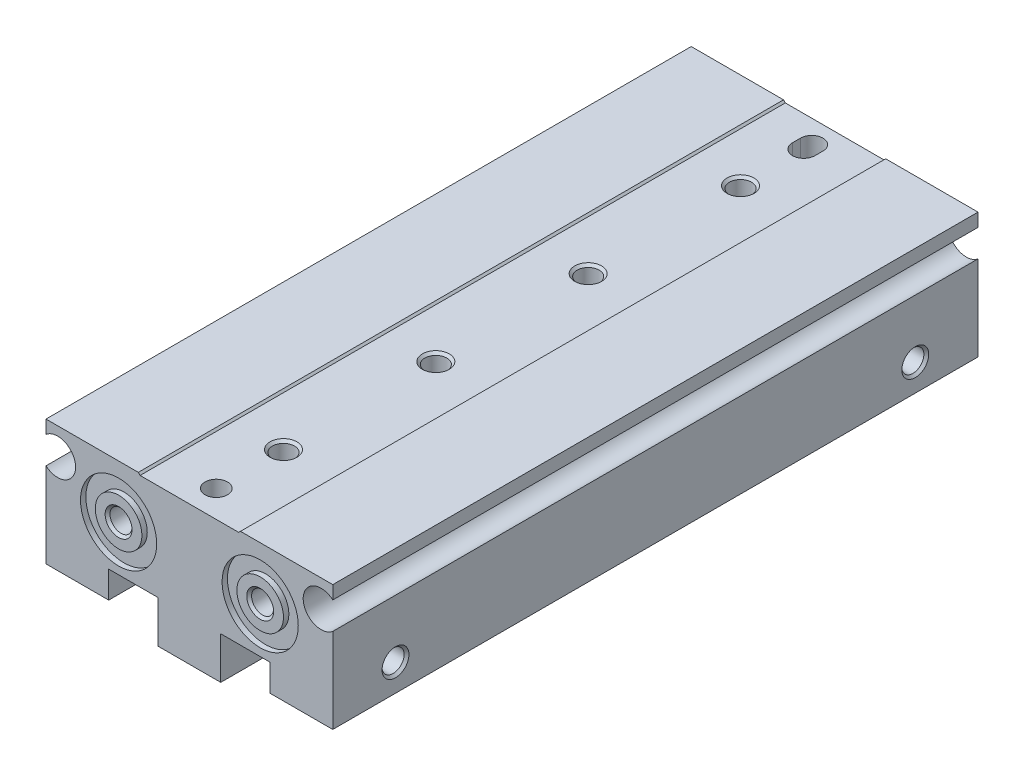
ISO-10303-21;
HEADER;
FILE_DESCRIPTION(('STEP AP214'),'2;1');
FILE_NAME('part.step','',(''),(''),'','','');
FILE_SCHEMA(('AUTOMOTIVE_DESIGN { 1 0 10303 214 1 1 1 1 }'));
ENDSEC;
DATA;
#1=APPLICATION_CONTEXT('core data for automotive mechanical design processes');
#2=APPLICATION_PROTOCOL_DEFINITION('international standard','automotive_design',2000,#1);
#3=PRODUCT_CONTEXT('',#1,'mechanical');
#4=PRODUCT('Part','Part','',(#3));
#5=PRODUCT_RELATED_PRODUCT_CATEGORY('part','',(#4));
#6=PRODUCT_DEFINITION_FORMATION('','',#4);
#7=PRODUCT_DEFINITION_CONTEXT('part definition',#1,'design');
#8=PRODUCT_DEFINITION('design','',#6,#7);
#9=PRODUCT_DEFINITION_SHAPE('','',#8);
#10=(LENGTH_UNIT() NAMED_UNIT(*) SI_UNIT(.MILLI.,.METRE.));
#11=(NAMED_UNIT(*) PLANE_ANGLE_UNIT() SI_UNIT($,.RADIAN.));
#12=(NAMED_UNIT(*) SI_UNIT($,.STERADIAN.) SOLID_ANGLE_UNIT());
#13=UNCERTAINTY_MEASURE_WITH_UNIT(LENGTH_MEASURE(1.E-05),#10,'distance_accuracy_value','');
#14=(GEOMETRIC_REPRESENTATION_CONTEXT(3) GLOBAL_UNCERTAINTY_ASSIGNED_CONTEXT((#13)) GLOBAL_UNIT_ASSIGNED_CONTEXT((#10,
#11,#12)) REPRESENTATION_CONTEXT('',''));
#15=CARTESIAN_POINT('',(0.,0.,0.));
#16=DIRECTION('',(0.,0.,1.));
#17=DIRECTION('',(1.,0.,0.));
#18=AXIS2_PLACEMENT_3D('',#15,#16,#17);
#19=CARTESIAN_POINT('',(3.5,-11.,-10.1));
#20=DIRECTION('',(0.,-1.,0.));
#21=DIRECTION('',(1.,0.,0.));
#22=AXIS2_PLACEMENT_3D('',#19,#20,#21);
#23=PLANE('',#22);
#24=DIRECTION('',(1.,0.,0.));
#25=VECTOR('',#24,1.);
#26=CARTESIAN_POINT('',(3.5,-11.,-10.1));
#27=LINE('',#26,#25);
#28=CARTESIAN_POINT('',(3.5,-11.,-10.1));
#29=VERTEX_POINT('',#28);
#30=CARTESIAN_POINT('',(9.,-11.,-10.1));
#31=VERTEX_POINT('',#30);
#32=EDGE_CURVE('E227',#29,#31,#27,.T.);
#33=ORIENTED_EDGE('',*,*,#32,.T.);
#34=DIRECTION('',(0.,0.,1.));
#35=VECTOR('',#34,1.);
#36=CARTESIAN_POINT('',(9.,-11.,-10.1));
#37=LINE('',#36,#35);
#38=CARTESIAN_POINT('',(9.,-11.,36.));
#39=VERTEX_POINT('',#38);
#40=EDGE_CURVE('E240',#39,#31,#37,.F.);
#41=ORIENTED_EDGE('',*,*,#40,.F.);
#42=DIRECTION('',(-1.,0.,0.));
#43=VECTOR('',#42,1.);
#44=CARTESIAN_POINT('',(9.,-11.,36.));
#45=LINE('',#44,#43);
#46=CARTESIAN_POINT('',(3.5,-11.,36.));
#47=VERTEX_POINT('',#46);
#48=EDGE_CURVE('E248',#47,#39,#45,.F.);
#49=ORIENTED_EDGE('',*,*,#48,.F.);
#50=DIRECTION('',(0.,0.,-1.));
#51=VECTOR('',#50,1.);
#52=CARTESIAN_POINT('',(3.5,-11.,36.));
#53=LINE('',#52,#51);
#54=EDGE_CURVE('E242',#47,#29,#53,.T.);
#55=ORIENTED_EDGE('',*,*,#54,.T.);
#56=EDGE_LOOP('',(#33,#41,#49,#55));
#57=FACE_BOUND('',#56,.T.);
#58=ADVANCED_FACE('F16',(#57),#23,.T.);
#59=CARTESIAN_POINT('',(3.5,-11.,-36.));
#60=DIRECTION('',(0.,-1.,0.));
#61=DIRECTION('',(1.,0.,0.));
#62=AXIS2_PLACEMENT_3D('',#59,#60,#61);
#63=PLANE('',#62);
#64=DIRECTION('',(-1.,0.,0.));
#65=VECTOR('',#64,1.);
#66=CARTESIAN_POINT('',(9.00000000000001,-11.,-27.1));
#67=LINE('',#66,#65);
#68=CARTESIAN_POINT('',(9.00000000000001,-11.,-27.1));
#69=VERTEX_POINT('',#68);
#70=CARTESIAN_POINT('',(3.5,-11.,-27.1));
#71=VERTEX_POINT('',#70);
#72=EDGE_CURVE('E259',#69,#71,#67,.T.);
#73=ORIENTED_EDGE('',*,*,#72,.T.);
#74=DIRECTION('',(0.,0.,-1.));
#75=VECTOR('',#74,1.);
#76=CARTESIAN_POINT('',(3.5,-11.,-27.1));
#77=LINE('',#76,#75);
#78=CARTESIAN_POINT('',(3.5,-11.,-36.));
#79=VERTEX_POINT('',#78);
#80=EDGE_CURVE('E264',#71,#79,#77,.T.);
#81=ORIENTED_EDGE('',*,*,#80,.T.);
#82=DIRECTION('',(1.,0.,0.));
#83=VECTOR('',#82,1.);
#84=CARTESIAN_POINT('',(3.5,-11.,-36.));
#85=LINE('',#84,#83);
#86=CARTESIAN_POINT('',(9.00000000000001,-11.,-36.));
#87=VERTEX_POINT('',#86);
#88=EDGE_CURVE('E269',#79,#87,#85,.T.);
#89=ORIENTED_EDGE('',*,*,#88,.T.);
#90=DIRECTION('',(0.,0.,1.));
#91=VECTOR('',#90,1.);
#92=CARTESIAN_POINT('',(9.00000000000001,-11.,-36.));
#93=LINE('',#92,#91);
#94=EDGE_CURVE('E274',#69,#87,#93,.F.);
#95=ORIENTED_EDGE('',*,*,#94,.F.);
#96=EDGE_LOOP('',(#73,#81,#89,#95));
#97=FACE_BOUND('',#96,.T.);
#98=ADVANCED_FACE('F910',(#97),#63,.T.);
#99=CARTESIAN_POINT('',(-9.,-11.,27.1));
#100=DIRECTION('',(0.,-1.,0.));
#101=DIRECTION('',(1.,0.,0.));
#102=AXIS2_PLACEMENT_3D('',#99,#100,#101);
#103=PLANE('',#102);
#104=DIRECTION('',(1.,0.,0.));
#105=VECTOR('',#104,1.);
#106=CARTESIAN_POINT('',(-9.,-11.,27.1));
#107=LINE('',#106,#105);
#108=CARTESIAN_POINT('',(-9.,-11.,27.1));
#109=VERTEX_POINT('',#108);
#110=CARTESIAN_POINT('',(-3.5,-11.,27.1));
#111=VERTEX_POINT('',#110);
#112=EDGE_CURVE('E279',#109,#111,#107,.T.);
#113=ORIENTED_EDGE('',*,*,#112,.T.);
#114=DIRECTION('',(0.,0.,1.));
#115=VECTOR('',#114,1.);
#116=CARTESIAN_POINT('',(-3.5,-11.,27.1));
#117=LINE('',#116,#115);
#118=CARTESIAN_POINT('',(-3.5,-11.,36.));
#119=VERTEX_POINT('',#118);
#120=EDGE_CURVE('E284',#119,#111,#117,.F.);
#121=ORIENTED_EDGE('',*,*,#120,.F.);
#122=DIRECTION('',(-1.,0.,0.));
#123=VECTOR('',#122,1.);
#124=CARTESIAN_POINT('',(-3.5,-11.,36.));
#125=LINE('',#124,#123);
#126=CARTESIAN_POINT('',(-9.,-11.,36.));
#127=VERTEX_POINT('',#126);
#128=EDGE_CURVE('E289',#127,#119,#125,.F.);
#129=ORIENTED_EDGE('',*,*,#128,.F.);
#130=DIRECTION('',(0.,0.,-1.));
#131=VECTOR('',#130,1.);
#132=CARTESIAN_POINT('',(-9.,-11.,36.));
#133=LINE('',#132,#131);
#134=EDGE_CURVE('E293',#127,#109,#133,.T.);
#135=ORIENTED_EDGE('',*,*,#134,.T.);
#136=EDGE_LOOP('',(#113,#121,#129,#135));
#137=FACE_BOUND('',#136,.T.);
#138=ADVANCED_FACE('F915',(#137),#103,.T.);
#139=CARTESIAN_POINT('',(-9.,-11.,-36.));
#140=DIRECTION('',(0.,-1.,0.));
#141=DIRECTION('',(1.,0.,0.));
#142=AXIS2_PLACEMENT_3D('',#139,#140,#141);
#143=PLANE('',#142);
#144=DIRECTION('',(-1.,0.,0.));
#145=VECTOR('',#144,1.);
#146=CARTESIAN_POINT('',(-3.5,-11.,10.1));
#147=LINE('',#146,#145);
#148=CARTESIAN_POINT('',(-3.5,-11.,10.1));
#149=VERTEX_POINT('',#148);
#150=CARTESIAN_POINT('',(-9.,-11.,10.1));
#151=VERTEX_POINT('',#150);
#152=EDGE_CURVE('E298',#149,#151,#147,.T.);
#153=ORIENTED_EDGE('',*,*,#152,.T.);
#154=DIRECTION('',(0.,0.,-1.));
#155=VECTOR('',#154,1.);
#156=CARTESIAN_POINT('',(-9.,-11.,10.1));
#157=LINE('',#156,#155);
#158=CARTESIAN_POINT('',(-9.,-11.,-36.));
#159=VERTEX_POINT('',#158);
#160=EDGE_CURVE('E303',#151,#159,#157,.T.);
#161=ORIENTED_EDGE('',*,*,#160,.T.);
#162=DIRECTION('',(1.,0.,0.));
#163=VECTOR('',#162,1.);
#164=CARTESIAN_POINT('',(-9.,-11.,-36.));
#165=LINE('',#164,#163);
#166=CARTESIAN_POINT('',(-3.5,-11.,-36.));
#167=VERTEX_POINT('',#166);
#168=EDGE_CURVE('E308',#159,#167,#165,.T.);
#169=ORIENTED_EDGE('',*,*,#168,.T.);
#170=DIRECTION('',(0.,0.,1.));
#171=VECTOR('',#170,1.);
#172=CARTESIAN_POINT('',(-3.5,-11.,-36.));
#173=LINE('',#172,#171);
#174=EDGE_CURVE('E313',#149,#167,#173,.F.);
#175=ORIENTED_EDGE('',*,*,#174,.F.);
#176=EDGE_LOOP('',(#153,#161,#169,#175));
#177=FACE_BOUND('',#176,.T.);
#178=ADVANCED_FACE('F921',(#177),#143,.T.);
#179=CARTESIAN_POINT('',(-16.,-1.48013158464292,36.));
#180=DIRECTION('',(-1.,0.,0.));
#181=DIRECTION('',(0.,1.,0.));
#182=AXIS2_PLACEMENT_3D('',#179,#180,#181);
#183=PLANE('',#182);
#184=DIRECTION('',(0.,-1.,0.));
#185=VECTOR('',#184,1.);
#186=CARTESIAN_POINT('',(-16.,0.,-36.));
#187=LINE('',#186,#185);
#188=CARTESIAN_POINT('',(-16.,0.,-36.));
#189=VERTEX_POINT('',#188);
#190=CARTESIAN_POINT('',(-16.,-1.48013158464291,-36.));
#191=VERTEX_POINT('',#190);
#192=EDGE_CURVE('E318',#189,#191,#187,.T.);
#193=ORIENTED_EDGE('',*,*,#192,.T.);
#194=DIRECTION('',(0.,0.,1.));
#195=VECTOR('',#194,1.);
#196=CARTESIAN_POINT('',(-16.,-1.48013158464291,-36.));
#197=LINE('',#196,#195);
#198=CARTESIAN_POINT('',(-16.,-1.48013158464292,36.));
#199=VERTEX_POINT('',#198);
#200=EDGE_CURVE('E323',#199,#191,#197,.F.);
#201=ORIENTED_EDGE('',*,*,#200,.F.);
#202=DIRECTION('',(0.,1.,0.));
#203=VECTOR('',#202,1.);
#204=CARTESIAN_POINT('',(-16.,-1.48013158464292,36.));
#205=LINE('',#204,#203);
#206=CARTESIAN_POINT('',(-16.,0.,36.));
#207=VERTEX_POINT('',#206);
#208=EDGE_CURVE('E328',#207,#199,#205,.F.);
#209=ORIENTED_EDGE('',*,*,#208,.F.);
#210=DIRECTION('',(0.,0.,-1.));
#211=VECTOR('',#210,1.);
#212=CARTESIAN_POINT('',(-16.,0.,36.));
#213=LINE('',#212,#211);
#214=EDGE_CURVE('E332',#207,#189,#213,.T.);
#215=ORIENTED_EDGE('',*,*,#214,.T.);
#216=EDGE_LOOP('',(#193,#201,#209,#215));
#217=FACE_BOUND('',#216,.T.);
#218=ADVANCED_FACE('F925',(#217),#183,.T.);
#219=CARTESIAN_POINT('',(-14.7,-3.,36.));
#220=DIRECTION('',(0.,0.,-1.));
#221=DIRECTION('',(-0.649999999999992,0.75993420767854,0.));
#222=AXIS2_PLACEMENT_3D('',#219,#220,#221);
#223=CYLINDRICAL_SURFACE('',#222,2.);
#224=ORIENTED_EDGE('',*,*,#200,.T.);
#225=CARTESIAN_POINT('',(-14.7,-3.,-36.));
#226=DIRECTION('',(0.,0.,-1.));
#227=DIRECTION('',(-0.649999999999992,0.75993420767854,0.));
#228=AXIS2_PLACEMENT_3D('',#225,#226,#227);
#229=CIRCLE('',#228,2.);
#230=CARTESIAN_POINT('',(-16.,-4.51986841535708,-36.));
#231=VERTEX_POINT('',#230);
#232=EDGE_CURVE('E337',#231,#191,#229,.F.);
#233=ORIENTED_EDGE('',*,*,#232,.F.);
#234=DIRECTION('',(0.,0.,1.));
#235=VECTOR('',#234,1.);
#236=CARTESIAN_POINT('',(-16.,-4.51986841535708,-36.));
#237=LINE('',#236,#235);
#238=CARTESIAN_POINT('',(-16.,-4.51986841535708,36.));
#239=VERTEX_POINT('',#238);
#240=EDGE_CURVE('E341',#239,#231,#237,.F.);
#241=ORIENTED_EDGE('',*,*,#240,.F.);
#242=CARTESIAN_POINT('',(-14.7,-3.,36.));
#243=DIRECTION('',(0.,0.,1.));
#244=DIRECTION('',(-0.649999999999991,-0.75993420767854,0.));
#245=AXIS2_PLACEMENT_3D('',#242,#243,#244);
#246=CIRCLE('',#245,2.);
#247=EDGE_CURVE('E346',#239,#199,#246,.T.);
#248=ORIENTED_EDGE('',*,*,#247,.T.);
#249=EDGE_LOOP('',(#224,#233,#241,#248));
#250=FACE_BOUND('',#249,.T.);
#251=ADVANCED_FACE('F929',(#250),#223,.F.);
#252=CARTESIAN_POINT('',(-16.,-14.,36.));
#253=DIRECTION('',(-1.,0.,0.));
#254=DIRECTION('',(0.,1.,0.));
#255=AXIS2_PLACEMENT_3D('',#252,#253,#254);
#256=PLANE('',#255);
#257=DIRECTION('',(0.,-1.,0.));
#258=VECTOR('',#257,1.);
#259=CARTESIAN_POINT('',(-16.,-4.51986841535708,-36.));
#260=LINE('',#259,#258);
#261=CARTESIAN_POINT('',(-16.,-14.,-36.));
#262=VERTEX_POINT('',#261);
#263=EDGE_CURVE('E351',#231,#262,#260,.T.);
#264=ORIENTED_EDGE('',*,*,#263,.T.);
#265=DIRECTION('',(0.,0.,1.));
#266=VECTOR('',#265,1.);
#267=CARTESIAN_POINT('',(-16.,-14.,-36.));
#268=LINE('',#267,#266);
#269=CARTESIAN_POINT('',(-16.,-14.,36.));
#270=VERTEX_POINT('',#269);
#271=EDGE_CURVE('E356',#270,#262,#268,.F.);
#272=ORIENTED_EDGE('',*,*,#271,.F.);
#273=DIRECTION('',(0.,1.,0.));
#274=VECTOR('',#273,1.);
#275=CARTESIAN_POINT('',(-16.,-14.,36.));
#276=LINE('',#275,#274);
#277=EDGE_CURVE('E361',#239,#270,#276,.F.);
#278=ORIENTED_EDGE('',*,*,#277,.F.);
#279=ORIENTED_EDGE('',*,*,#240,.T.);
#280=EDGE_LOOP('',(#264,#272,#278,#279));
#281=FACE_BOUND('',#280,.T.);
#282=CARTESIAN_POINT('',(-16.,-11.,-29.));
#283=DIRECTION('',(1.,0.,0.));
#284=DIRECTION('',(0.,0.,1.));
#285=AXIS2_PLACEMENT_3D('',#282,#283,#284);
#286=CIRCLE('',#285,1.5);
#287=CARTESIAN_POINT('',(-16.,-11.,-27.5));
#288=VERTEX_POINT('',#287);
#289=EDGE_CURVE('E365',#288,#288,#286,.F.);
#290=ORIENTED_EDGE('',*,*,#289,.F.);
#291=EDGE_LOOP('',(#290));
#292=FACE_BOUND('',#291,.T.);
#293=CARTESIAN_POINT('',(-16.,-11.,29.));
#294=DIRECTION('',(1.,0.,0.));
#295=DIRECTION('',(0.,0.,1.));
#296=AXIS2_PLACEMENT_3D('',#293,#294,#295);
#297=CIRCLE('',#296,1.5);
#298=CARTESIAN_POINT('',(-16.,-11.,30.5));
#299=VERTEX_POINT('',#298);
#300=EDGE_CURVE('E370',#299,#299,#297,.F.);
#301=ORIENTED_EDGE('',*,*,#300,.F.);
#302=EDGE_LOOP('',(#301));
#303=FACE_BOUND('',#302,.T.);
#304=ADVANCED_FACE('F933',(#281,#292,#303),#256,.T.);
#305=CARTESIAN_POINT('',(-16.,-14.,-36.));
#306=DIRECTION('',(0.,-1.,0.));
#307=DIRECTION('',(1.,0.,0.));
#308=AXIS2_PLACEMENT_3D('',#305,#306,#307);
#309=PLANE('',#308);
#310=DIRECTION('',(1.,0.,0.));
#311=VECTOR('',#310,1.);
#312=CARTESIAN_POINT('',(-16.,-14.,-36.));
#313=LINE('',#312,#311);
#314=CARTESIAN_POINT('',(-9.,-14.,-36.));
#315=VERTEX_POINT('',#314);
#316=EDGE_CURVE('E373',#262,#315,#313,.T.);
#317=ORIENTED_EDGE('',*,*,#316,.T.);
#318=DIRECTION('',(0.,0.,1.));
#319=VECTOR('',#318,1.);
#320=CARTESIAN_POINT('',(-9.,-14.,-36.));
#321=LINE('',#320,#319);
#322=CARTESIAN_POINT('',(-9.,-14.,36.));
#323=VERTEX_POINT('',#322);
#324=EDGE_CURVE('E376',#323,#315,#321,.F.);
#325=ORIENTED_EDGE('',*,*,#324,.F.);
#326=DIRECTION('',(-1.,0.,0.));
#327=VECTOR('',#326,1.);
#328=CARTESIAN_POINT('',(-9.,-14.,36.));
#329=LINE('',#328,#327);
#330=EDGE_CURVE('E381',#270,#323,#329,.F.);
#331=ORIENTED_EDGE('',*,*,#330,.F.);
#332=ORIENTED_EDGE('',*,*,#271,.T.);
#333=EDGE_LOOP('',(#317,#325,#331,#332));
#334=FACE_BOUND('',#333,.T.);
#335=CARTESIAN_POINT('',(-13.,-14.,25.));
#336=DIRECTION('',(0.,1.,0.));
#337=DIRECTION('',(0.,0.,-1.));
#338=AXIS2_PLACEMENT_3D('',#335,#336,#337);
#339=CIRCLE('',#338,1.5);
#340=CARTESIAN_POINT('',(-13.,-14.,23.5));
#341=VERTEX_POINT('',#340);
#342=EDGE_CURVE('E385',#341,#341,#339,.T.);
#343=ORIENTED_EDGE('',*,*,#342,.T.);
#344=EDGE_LOOP('',(#343));
#345=FACE_BOUND('',#344,.T.);
#346=CARTESIAN_POINT('',(-13.,-14.,-25.));
#347=DIRECTION('',(0.,1.,0.));
#348=DIRECTION('',(-1.42053989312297E-07,0.,-0.99999999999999));
#349=AXIS2_PLACEMENT_3D('',#346,#347,#348);
#350=CIRCLE('',#349,1.5);
#351=CARTESIAN_POINT('',(-13.000000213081,-14.,-26.5));
#352=VERTEX_POINT('',#351);
#353=EDGE_CURVE('E390',#352,#352,#350,.T.);
#354=ORIENTED_EDGE('',*,*,#353,.T.);
#355=EDGE_LOOP('',(#354));
#356=FACE_BOUND('',#355,.T.);
#357=ADVANCED_FACE('F937',(#334,#345,#356),#309,.T.);
#358=CARTESIAN_POINT('',(-9.,-14.,-36.));
#359=DIRECTION('',(1.,0.,0.));
#360=DIRECTION('',(0.,1.,0.));
#361=AXIS2_PLACEMENT_3D('',#358,#359,#360);
#362=PLANE('',#361);
#363=DIRECTION('',(0.,1.,0.));
#364=VECTOR('',#363,1.);
#365=CARTESIAN_POINT('',(-9.,-14.,-36.));
#366=LINE('',#365,#364);
#367=EDGE_CURVE('E393',#315,#159,#366,.T.);
#368=ORIENTED_EDGE('',*,*,#367,.T.);
#369=ORIENTED_EDGE('',*,*,#160,.F.);
#370=DIRECTION('',(0.,1.,0.));
#371=VECTOR('',#370,1.);
#372=CARTESIAN_POINT('',(-9.,-11.,10.1));
#373=LINE('',#372,#371);
#374=CARTESIAN_POINT('',(-9.,-9.4,10.1));
#375=VERTEX_POINT('',#374);
#376=EDGE_CURVE('E396',#375,#151,#373,.F.);
#377=ORIENTED_EDGE('',*,*,#376,.F.);
#378=DIRECTION('',(0.,0.,1.));
#379=VECTOR('',#378,1.);
#380=CARTESIAN_POINT('',(-9.,-9.4,10.1));
#381=LINE('',#380,#379);
#382=CARTESIAN_POINT('',(-9.,-9.4,27.1));
#383=VERTEX_POINT('',#382);
#384=EDGE_CURVE('E400',#375,#383,#381,.T.);
#385=ORIENTED_EDGE('',*,*,#384,.T.);
#386=DIRECTION('',(0.,-1.,0.));
#387=VECTOR('',#386,1.);
#388=CARTESIAN_POINT('',(-9.,-9.4,27.1));
#389=LINE('',#388,#387);
#390=EDGE_CURVE('E405',#383,#109,#389,.T.);
#391=ORIENTED_EDGE('',*,*,#390,.T.);
#392=ORIENTED_EDGE('',*,*,#134,.F.);
#393=DIRECTION('',(0.,-1.,0.));
#394=VECTOR('',#393,1.);
#395=CARTESIAN_POINT('',(-9.,-11.,36.));
#396=LINE('',#395,#394);
#397=EDGE_CURVE('E410',#323,#127,#396,.F.);
#398=ORIENTED_EDGE('',*,*,#397,.F.);
#399=ORIENTED_EDGE('',*,*,#324,.T.);
#400=EDGE_LOOP('',(#368,#369,#377,#385,#391,#392,#398,#399));
#401=FACE_BOUND('',#400,.T.);
#402=ADVANCED_FACE('F941',(#401),#362,.T.);
#403=CARTESIAN_POINT('',(-3.5,-15.7,36.));
#404=DIRECTION('',(-1.,0.,0.));
#405=DIRECTION('',(0.,1.,0.));
#406=AXIS2_PLACEMENT_3D('',#403,#404,#405);
#407=PLANE('',#406);
#408=DIRECTION('',(0.,-1.,0.));
#409=VECTOR('',#408,1.);
#410=CARTESIAN_POINT('',(-3.5,-11.,-36.));
#411=LINE('',#410,#409);
#412=CARTESIAN_POINT('',(-3.5,-15.7,-36.));
#413=VERTEX_POINT('',#412);
#414=EDGE_CURVE('E414',#167,#413,#411,.T.);
#415=ORIENTED_EDGE('',*,*,#414,.T.);
#416=DIRECTION('',(0.,0.,1.));
#417=VECTOR('',#416,1.);
#418=CARTESIAN_POINT('',(-3.5,-15.7,-36.));
#419=LINE('',#418,#417);
#420=CARTESIAN_POINT('',(-3.5,-15.7,36.));
#421=VERTEX_POINT('',#420);
#422=EDGE_CURVE('E419',#421,#413,#419,.F.);
#423=ORIENTED_EDGE('',*,*,#422,.F.);
#424=DIRECTION('',(0.,1.,0.));
#425=VECTOR('',#424,1.);
#426=CARTESIAN_POINT('',(-3.5,-15.7,36.));
#427=LINE('',#426,#425);
#428=EDGE_CURVE('E424',#119,#421,#427,.F.);
#429=ORIENTED_EDGE('',*,*,#428,.F.);
#430=ORIENTED_EDGE('',*,*,#120,.T.);
#431=DIRECTION('',(0.,1.,0.));
#432=VECTOR('',#431,1.);
#433=CARTESIAN_POINT('',(-3.5,-11.,27.1));
#434=LINE('',#433,#432);
#435=CARTESIAN_POINT('',(-3.5,-9.4,27.1));
#436=VERTEX_POINT('',#435);
#437=EDGE_CURVE('E428',#436,#111,#434,.F.);
#438=ORIENTED_EDGE('',*,*,#437,.F.);
#439=DIRECTION('',(0.,0.,-1.));
#440=VECTOR('',#439,1.);
#441=CARTESIAN_POINT('',(-3.5,-9.4,27.1));
#442=LINE('',#441,#440);
#443=CARTESIAN_POINT('',(-3.5,-9.4,10.1));
#444=VERTEX_POINT('',#443);
#445=EDGE_CURVE('E432',#436,#444,#442,.T.);
#446=ORIENTED_EDGE('',*,*,#445,.T.);
#447=DIRECTION('',(0.,-1.,0.));
#448=VECTOR('',#447,1.);
#449=CARTESIAN_POINT('',(-3.5,-9.4,10.1));
#450=LINE('',#449,#448);
#451=EDGE_CURVE('E437',#444,#149,#450,.T.);
#452=ORIENTED_EDGE('',*,*,#451,.T.);
#453=ORIENTED_EDGE('',*,*,#174,.T.);
#454=EDGE_LOOP('',(#415,#423,#429,#430,#438,#446,#452,#453));
#455=FACE_BOUND('',#454,.T.);
#456=ADVANCED_FACE('F945',(#455),#407,.T.);
#457=CARTESIAN_POINT('',(-3.5,-15.7,-36.));
#458=DIRECTION('',(0.,-1.,0.));
#459=DIRECTION('',(1.,0.,0.));
#460=AXIS2_PLACEMENT_3D('',#457,#458,#459);
#461=PLANE('',#460);
#462=DIRECTION('',(1.,0.,0.));
#463=VECTOR('',#462,1.);
#464=CARTESIAN_POINT('',(-3.5,-15.7,-36.));
#465=LINE('',#464,#463);
#466=CARTESIAN_POINT('',(3.5,-15.7,-36.));
#467=VERTEX_POINT('',#466);
#468=EDGE_CURVE('E442',#413,#467,#465,.T.);
#469=ORIENTED_EDGE('',*,*,#468,.T.);
#470=DIRECTION('',(0.,0.,1.));
#471=VECTOR('',#470,1.);
#472=CARTESIAN_POINT('',(3.5,-15.7,-36.));
#473=LINE('',#472,#471);
#474=CARTESIAN_POINT('',(3.5,-15.7,36.));
#475=VERTEX_POINT('',#474);
#476=EDGE_CURVE('E447',#475,#467,#473,.F.);
#477=ORIENTED_EDGE('',*,*,#476,.F.);
#478=DIRECTION('',(-1.,0.,0.));
#479=VECTOR('',#478,1.);
#480=CARTESIAN_POINT('',(3.5,-15.7,36.));
#481=LINE('',#480,#479);
#482=EDGE_CURVE('E452',#421,#475,#481,.F.);
#483=ORIENTED_EDGE('',*,*,#482,.F.);
#484=ORIENTED_EDGE('',*,*,#422,.T.);
#485=EDGE_LOOP('',(#469,#477,#483,#484));
#486=FACE_BOUND('',#485,.T.);
#487=CARTESIAN_POINT('',(0.,-15.7,8.5));
#488=DIRECTION('',(0.,1.,0.));
#489=DIRECTION('',(0.,0.,-1.));
#490=AXIS2_PLACEMENT_3D('',#487,#488,#489);
#491=CIRCLE('',#490,2.25);
#492=CARTESIAN_POINT('',(0.,-15.7,6.25));
#493=VERTEX_POINT('',#492);
#494=EDGE_CURVE('E456',#493,#493,#491,.F.);
#495=ORIENTED_EDGE('',*,*,#494,.F.);
#496=EDGE_LOOP('',(#495));
#497=FACE_BOUND('',#496,.T.);
#498=CARTESIAN_POINT('',(0.,-15.7,25.5));
#499=DIRECTION('',(0.,1.,0.));
#500=DIRECTION('',(0.,0.,-1.));
#501=AXIS2_PLACEMENT_3D('',#498,#499,#500);
#502=CIRCLE('',#501,2.25);
#503=CARTESIAN_POINT('',(0.,-15.7,23.25));
#504=VERTEX_POINT('',#503);
#505=EDGE_CURVE('E461',#504,#504,#502,.F.);
#506=ORIENTED_EDGE('',*,*,#505,.F.);
#507=EDGE_LOOP('',(#506));
#508=FACE_BOUND('',#507,.T.);
#509=CARTESIAN_POINT('',(0.,-15.7,-25.5));
#510=DIRECTION('',(0.,1.,0.));
#511=DIRECTION('',(0.,0.,-1.));
#512=AXIS2_PLACEMENT_3D('',#509,#510,#511);
#513=CIRCLE('',#512,2.25);
#514=CARTESIAN_POINT('',(0.,-15.7,-27.75));
#515=VERTEX_POINT('',#514);
#516=EDGE_CURVE('E464',#515,#515,#513,.F.);
#517=ORIENTED_EDGE('',*,*,#516,.F.);
#518=EDGE_LOOP('',(#517));
#519=FACE_BOUND('',#518,.T.);
#520=CARTESIAN_POINT('',(0.,-15.7,-8.5));
#521=DIRECTION('',(0.,1.,0.));
#522=DIRECTION('',(0.,0.,-1.));
#523=AXIS2_PLACEMENT_3D('',#520,#521,#522);
#524=CIRCLE('',#523,2.25);
#525=CARTESIAN_POINT('',(0.,-15.7,-10.75));
#526=VERTEX_POINT('',#525);
#527=EDGE_CURVE('E467',#526,#526,#524,.F.);
#528=ORIENTED_EDGE('',*,*,#527,.F.);
#529=EDGE_LOOP('',(#528));
#530=FACE_BOUND('',#529,.T.);
#531=ADVANCED_FACE('F949',(#486,#497,#508,#519,#530),#461,.T.);
#532=CARTESIAN_POINT('',(3.5,-15.7,-36.));
#533=DIRECTION('',(1.,0.,0.));
#534=DIRECTION('',(0.,1.,0.));
#535=AXIS2_PLACEMENT_3D('',#532,#533,#534);
#536=PLANE('',#535);
#537=DIRECTION('',(0.,1.,0.));
#538=VECTOR('',#537,1.);
#539=CARTESIAN_POINT('',(3.5,-15.7,-36.));
#540=LINE('',#539,#538);
#541=EDGE_CURVE('E470',#467,#79,#540,.T.);
#542=ORIENTED_EDGE('',*,*,#541,.T.);
#543=ORIENTED_EDGE('',*,*,#80,.F.);
#544=DIRECTION('',(0.,1.,0.));
#545=VECTOR('',#544,1.);
#546=CARTESIAN_POINT('',(3.5,-11.,-27.1));
#547=LINE('',#546,#545);
#548=CARTESIAN_POINT('',(3.5,-9.4,-27.1));
#549=VERTEX_POINT('',#548);
#550=EDGE_CURVE('E473',#549,#71,#547,.F.);
#551=ORIENTED_EDGE('',*,*,#550,.F.);
#552=DIRECTION('',(0.,0.,1.));
#553=VECTOR('',#552,1.);
#554=CARTESIAN_POINT('',(3.5,-9.4,-27.1));
#555=LINE('',#554,#553);
#556=CARTESIAN_POINT('',(3.5,-9.4,-10.1));
#557=VERTEX_POINT('',#556);
#558=EDGE_CURVE('E477',#549,#557,#555,.T.);
#559=ORIENTED_EDGE('',*,*,#558,.T.);
#560=DIRECTION('',(0.,-1.,0.));
#561=VECTOR('',#560,1.);
#562=CARTESIAN_POINT('',(3.5,-9.4,-10.1));
#563=LINE('',#562,#561);
#564=EDGE_CURVE('E482',#557,#29,#563,.T.);
#565=ORIENTED_EDGE('',*,*,#564,.T.);
#566=ORIENTED_EDGE('',*,*,#54,.F.);
#567=DIRECTION('',(0.,-1.,0.));
#568=VECTOR('',#567,1.);
#569=CARTESIAN_POINT('',(3.5,-11.,36.));
#570=LINE('',#569,#568);
#571=EDGE_CURVE('E486',#475,#47,#570,.F.);
#572=ORIENTED_EDGE('',*,*,#571,.F.);
#573=ORIENTED_EDGE('',*,*,#476,.T.);
#574=EDGE_LOOP('',(#542,#543,#551,#559,#565,#566,#572,#573));
#575=FACE_BOUND('',#574,.T.);
#576=ADVANCED_FACE('F953',(#575),#536,.T.);
#577=CARTESIAN_POINT('',(9.,-14.,36.));
#578=DIRECTION('',(-1.,0.,0.));
#579=DIRECTION('',(0.,1.,0.));
#580=AXIS2_PLACEMENT_3D('',#577,#578,#579);
#581=PLANE('',#580);
#582=DIRECTION('',(0.,-1.,0.));
#583=VECTOR('',#582,1.);
#584=CARTESIAN_POINT('',(9.,-11.,-36.));
#585=LINE('',#584,#583);
#586=CARTESIAN_POINT('',(9.,-14.,-36.));
#587=VERTEX_POINT('',#586);
#588=EDGE_CURVE('E490',#87,#587,#585,.T.);
#589=ORIENTED_EDGE('',*,*,#588,.T.);
#590=DIRECTION('',(0.,0.,1.));
#591=VECTOR('',#590,1.);
#592=CARTESIAN_POINT('',(9.,-14.,-36.));
#593=LINE('',#592,#591);
#594=CARTESIAN_POINT('',(9.,-14.,36.));
#595=VERTEX_POINT('',#594);
#596=EDGE_CURVE('E494',#595,#587,#593,.F.);
#597=ORIENTED_EDGE('',*,*,#596,.F.);
#598=DIRECTION('',(0.,1.,0.));
#599=VECTOR('',#598,1.);
#600=CARTESIAN_POINT('',(9.,-14.,36.));
#601=LINE('',#600,#599);
#602=EDGE_CURVE('E234',#39,#595,#601,.F.);
#603=ORIENTED_EDGE('',*,*,#602,.F.);
#604=ORIENTED_EDGE('',*,*,#40,.T.);
#605=DIRECTION('',(0.,1.,0.));
#606=VECTOR('',#605,1.);
#607=CARTESIAN_POINT('',(9.,-11.,-10.1));
#608=LINE('',#607,#606);
#609=CARTESIAN_POINT('',(9.,-9.4,-10.1));
#610=VERTEX_POINT('',#609);
#611=EDGE_CURVE('E223',#610,#31,#608,.F.);
#612=ORIENTED_EDGE('',*,*,#611,.F.);
#613=DIRECTION('',(0.,0.,-1.));
#614=VECTOR('',#613,1.);
#615=CARTESIAN_POINT('',(9.,-9.4,-10.1));
#616=LINE('',#615,#614);
#617=CARTESIAN_POINT('',(9.,-9.4,-27.1));
#618=VERTEX_POINT('',#617);
#619=EDGE_CURVE('E233',#610,#618,#616,.T.);
#620=ORIENTED_EDGE('',*,*,#619,.T.);
#621=DIRECTION('',(0.,-1.,0.));
#622=VECTOR('',#621,1.);
#623=CARTESIAN_POINT('',(9.,-9.4,-27.1));
#624=LINE('',#623,#622);
#625=EDGE_CURVE('E507',#618,#69,#624,.T.);
#626=ORIENTED_EDGE('',*,*,#625,.T.);
#627=ORIENTED_EDGE('',*,*,#94,.T.);
#628=EDGE_LOOP('',(#589,#597,#603,#604,#612,#620,#626,#627));
#629=FACE_BOUND('',#628,.T.);
#630=ADVANCED_FACE('F246',(#629),#581,.T.);
#631=CARTESIAN_POINT('',(9.,-14.,-36.));
#632=DIRECTION('',(0.,-1.,0.));
#633=DIRECTION('',(1.,0.,0.));
#634=AXIS2_PLACEMENT_3D('',#631,#632,#633);
#635=PLANE('',#634);
#636=DIRECTION('',(1.,0.,0.));
#637=VECTOR('',#636,1.);
#638=CARTESIAN_POINT('',(9.,-14.,-36.));
#639=LINE('',#638,#637);
#640=CARTESIAN_POINT('',(16.,-14.,-36.));
#641=VERTEX_POINT('',#640);
#642=EDGE_CURVE('E512',#587,#641,#639,.T.);
#643=ORIENTED_EDGE('',*,*,#642,.T.);
#644=DIRECTION('',(0.,0.,1.));
#645=VECTOR('',#644,1.);
#646=CARTESIAN_POINT('',(16.,-14.,-36.));
#647=LINE('',#646,#645);
#648=CARTESIAN_POINT('',(16.,-14.,36.));
#649=VERTEX_POINT('',#648);
#650=EDGE_CURVE('E517',#649,#641,#647,.F.);
#651=ORIENTED_EDGE('',*,*,#650,.F.);
#652=DIRECTION('',(-1.,0.,0.));
#653=VECTOR('',#652,1.);
#654=CARTESIAN_POINT('',(16.,-14.,36.));
#655=LINE('',#654,#653);
#656=EDGE_CURVE('E522',#595,#649,#655,.F.);
#657=ORIENTED_EDGE('',*,*,#656,.F.);
#658=ORIENTED_EDGE('',*,*,#596,.T.);
#659=EDGE_LOOP('',(#643,#651,#657,#658));
#660=FACE_BOUND('',#659,.T.);
#661=CARTESIAN_POINT('',(13.,-14.,-25.));
#662=DIRECTION('',(0.,1.,0.));
#663=DIRECTION('',(-1.4205398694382E-07,0.,-0.99999999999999));
#664=AXIS2_PLACEMENT_3D('',#661,#662,#663);
#665=CIRCLE('',#664,1.5);
#666=CARTESIAN_POINT('',(12.999999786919,-14.,-26.5));
#667=VERTEX_POINT('',#666);
#668=EDGE_CURVE('E526',#667,#667,#665,.T.);
#669=ORIENTED_EDGE('',*,*,#668,.T.);
#670=EDGE_LOOP('',(#669));
#671=FACE_BOUND('',#670,.T.);
#672=CARTESIAN_POINT('',(13.,-14.,25.));
#673=DIRECTION('',(0.,1.,0.));
#674=DIRECTION('',(0.,0.,-1.));
#675=AXIS2_PLACEMENT_3D('',#672,#673,#674);
#676=CIRCLE('',#675,1.5);
#677=CARTESIAN_POINT('',(13.,-14.,23.5));
#678=VERTEX_POINT('',#677);
#679=EDGE_CURVE('E531',#678,#678,#676,.T.);
#680=ORIENTED_EDGE('',*,*,#679,.T.);
#681=EDGE_LOOP('',(#680));
#682=FACE_BOUND('',#681,.T.);
#683=ADVANCED_FACE('F960',(#660,#671,#682),#635,.T.);
#684=CARTESIAN_POINT('',(16.,-14.,-36.));
#685=DIRECTION('',(1.,0.,0.));
#686=DIRECTION('',(0.,1.,0.));
#687=AXIS2_PLACEMENT_3D('',#684,#685,#686);
#688=PLANE('',#687);
#689=DIRECTION('',(0.,1.,0.));
#690=VECTOR('',#689,1.);
#691=CARTESIAN_POINT('',(16.,-14.,-36.));
#692=LINE('',#691,#690);
#693=CARTESIAN_POINT('',(16.,-4.5198684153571,-36.));
#694=VERTEX_POINT('',#693);
#695=EDGE_CURVE('E534',#641,#694,#692,.T.);
#696=ORIENTED_EDGE('',*,*,#695,.T.);
#697=DIRECTION('',(0.,0.,1.));
#698=VECTOR('',#697,1.);
#699=CARTESIAN_POINT('',(16.,-4.5198684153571,-36.));
#700=LINE('',#699,#698);
#701=CARTESIAN_POINT('',(16.,-4.5198684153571,36.));
#702=VERTEX_POINT('',#701);
#703=EDGE_CURVE('E537',#702,#694,#700,.F.);
#704=ORIENTED_EDGE('',*,*,#703,.F.);
#705=DIRECTION('',(0.,-1.,0.));
#706=VECTOR('',#705,1.);
#707=CARTESIAN_POINT('',(16.,-4.5198684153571,36.));
#708=LINE('',#707,#706);
#709=EDGE_CURVE('E542',#649,#702,#708,.F.);
#710=ORIENTED_EDGE('',*,*,#709,.F.);
#711=ORIENTED_EDGE('',*,*,#650,.T.);
#712=EDGE_LOOP('',(#696,#704,#710,#711));
#713=FACE_BOUND('',#712,.T.);
#714=CARTESIAN_POINT('',(16.,-11.,-29.));
#715=DIRECTION('',(-1.,0.,0.));
#716=DIRECTION('',(0.,-1.4205372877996E-07,-0.99999999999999));
#717=AXIS2_PLACEMENT_3D('',#714,#715,#716);
#718=CIRCLE('',#717,1.5);
#719=CARTESIAN_POINT('',(16.,-11.0000002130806,-30.5));
#720=VERTEX_POINT('',#719);
#721=EDGE_CURVE('E546',#720,#720,#718,.T.);
#722=ORIENTED_EDGE('',*,*,#721,.T.);
#723=EDGE_LOOP('',(#722));
#724=FACE_BOUND('',#723,.T.);
#725=CARTESIAN_POINT('',(16.,-11.,29.));
#726=DIRECTION('',(-1.,0.,0.));
#727=DIRECTION('',(0.,0.,-1.));
#728=AXIS2_PLACEMENT_3D('',#725,#726,#727);
#729=CIRCLE('',#728,1.5);
#730=CARTESIAN_POINT('',(16.,-11.,27.5));
#731=VERTEX_POINT('',#730);
#732=EDGE_CURVE('E551',#731,#731,#729,.T.);
#733=ORIENTED_EDGE('',*,*,#732,.T.);
#734=EDGE_LOOP('',(#733));
#735=FACE_BOUND('',#734,.T.);
#736=ADVANCED_FACE('F963',(#713,#724,#735),#688,.T.);
#737=CARTESIAN_POINT('',(14.7,-3.,36.));
#738=DIRECTION('',(0.,0.,-1.));
#739=DIRECTION('',(0.649999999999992,-0.75993420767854,0.));
#740=AXIS2_PLACEMENT_3D('',#737,#738,#739);
#741=CYLINDRICAL_SURFACE('',#740,2.);
#742=ORIENTED_EDGE('',*,*,#703,.T.);
#743=CARTESIAN_POINT('',(14.7,-3.,-36.));
#744=DIRECTION('',(0.,0.,-1.));
#745=DIRECTION('',(0.649999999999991,-0.75993420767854,0.));
#746=AXIS2_PLACEMENT_3D('',#743,#744,#745);
#747=CIRCLE('',#746,2.);
#748=CARTESIAN_POINT('',(16.,-1.48013158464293,-36.));
#749=VERTEX_POINT('',#748);
#750=EDGE_CURVE('E554',#749,#694,#747,.F.);
#751=ORIENTED_EDGE('',*,*,#750,.F.);
#752=DIRECTION('',(0.,0.,1.));
#753=VECTOR('',#752,1.);
#754=CARTESIAN_POINT('',(16.,-1.48013158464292,-36.));
#755=LINE('',#754,#753);
#756=CARTESIAN_POINT('',(16.,-1.48013158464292,36.));
#757=VERTEX_POINT('',#756);
#758=EDGE_CURVE('E556',#757,#749,#755,.F.);
#759=ORIENTED_EDGE('',*,*,#758,.F.);
#760=CARTESIAN_POINT('',(14.7,-3.,36.));
#761=DIRECTION('',(0.,0.,1.));
#762=DIRECTION('',(0.649999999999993,0.759934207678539,0.));
#763=AXIS2_PLACEMENT_3D('',#760,#761,#762);
#764=CIRCLE('',#763,2.);
#765=EDGE_CURVE('E561',#757,#702,#764,.T.);
#766=ORIENTED_EDGE('',*,*,#765,.T.);
#767=EDGE_LOOP('',(#742,#751,#759,#766));
#768=FACE_BOUND('',#767,.T.);
#769=ADVANCED_FACE('F967',(#768),#741,.F.);
#770=CARTESIAN_POINT('',(16.,-1.48013158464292,-36.));
#771=DIRECTION('',(1.,0.,0.));
#772=DIRECTION('',(0.,1.,0.));
#773=AXIS2_PLACEMENT_3D('',#770,#771,#772);
#774=PLANE('',#773);
#775=DIRECTION('',(0.,1.,0.));
#776=VECTOR('',#775,1.);
#777=CARTESIAN_POINT('',(16.,-1.48013158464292,-36.));
#778=LINE('',#777,#776);
#779=CARTESIAN_POINT('',(16.,0.,-36.));
#780=VERTEX_POINT('',#779);
#781=EDGE_CURVE('E566',#749,#780,#778,.T.);
#782=ORIENTED_EDGE('',*,*,#781,.T.);
#783=DIRECTION('',(0.,0.,1.));
#784=VECTOR('',#783,1.);
#785=CARTESIAN_POINT('',(16.,0.,-36.));
#786=LINE('',#785,#784);
#787=CARTESIAN_POINT('',(16.,0.,36.));
#788=VERTEX_POINT('',#787);
#789=EDGE_CURVE('E571',#788,#780,#786,.F.);
#790=ORIENTED_EDGE('',*,*,#789,.F.);
#791=DIRECTION('',(0.,-1.,0.));
#792=VECTOR('',#791,1.);
#793=CARTESIAN_POINT('',(16.,0.,36.));
#794=LINE('',#793,#792);
#795=EDGE_CURVE('E576',#757,#788,#794,.F.);
#796=ORIENTED_EDGE('',*,*,#795,.F.);
#797=ORIENTED_EDGE('',*,*,#758,.T.);
#798=EDGE_LOOP('',(#782,#790,#796,#797));
#799=FACE_BOUND('',#798,.T.);
#800=ADVANCED_FACE('F971',(#799),#774,.T.);
#801=CARTESIAN_POINT('',(5.7,0.,36.));
#802=DIRECTION('',(0.,1.,0.));
#803=DIRECTION('',(1.,0.,0.));
#804=AXIS2_PLACEMENT_3D('',#801,#802,#803);
#805=PLANE('',#804);
#806=DIRECTION('',(-1.,0.,0.));
#807=VECTOR('',#806,1.);
#808=CARTESIAN_POINT('',(16.,0.,-36.));
#809=LINE('',#808,#807);
#810=CARTESIAN_POINT('',(5.7,0.,-36.));
#811=VERTEX_POINT('',#810);
#812=EDGE_CURVE('E580',#780,#811,#809,.T.);
#813=ORIENTED_EDGE('',*,*,#812,.T.);
#814=DIRECTION('',(0.,0.,1.));
#815=VECTOR('',#814,1.);
#816=CARTESIAN_POINT('',(5.7,0.,-36.));
#817=LINE('',#816,#815);
#818=CARTESIAN_POINT('',(5.7,0.,36.));
#819=VERTEX_POINT('',#818);
#820=EDGE_CURVE('E585',#819,#811,#817,.F.);
#821=ORIENTED_EDGE('',*,*,#820,.F.);
#822=DIRECTION('',(1.,0.,0.));
#823=VECTOR('',#822,1.);
#824=CARTESIAN_POINT('',(5.7,0.,36.));
#825=LINE('',#824,#823);
#826=EDGE_CURVE('E590',#788,#819,#825,.F.);
#827=ORIENTED_EDGE('',*,*,#826,.F.);
#828=ORIENTED_EDGE('',*,*,#789,.T.);
#829=EDGE_LOOP('',(#813,#821,#827,#828));
#830=FACE_BOUND('',#829,.T.);
#831=ADVANCED_FACE('F975',(#830),#805,.T.);
#832=CARTESIAN_POINT('',(5.5,-0.200000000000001,-36.));
#833=DIRECTION('',(-0.707106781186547,0.707106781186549,0.));
#834=DIRECTION('',(0.,0.,1.));
#835=AXIS2_PLACEMENT_3D('',#832,#833,#834);
#836=PLANE('',#835);
#837=DIRECTION('',(-0.707106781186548,-0.707106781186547,0.));
#838=VECTOR('',#837,1.);
#839=CARTESIAN_POINT('',(5.7,0.,-36.));
#840=LINE('',#839,#838);
#841=CARTESIAN_POINT('',(5.5,-0.200000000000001,-36.));
#842=VERTEX_POINT('',#841);
#843=EDGE_CURVE('E594',#811,#842,#840,.T.);
#844=ORIENTED_EDGE('',*,*,#843,.T.);
#845=DIRECTION('',(0.,0.,1.));
#846=VECTOR('',#845,1.);
#847=CARTESIAN_POINT('',(5.5,-0.200000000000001,-36.));
#848=LINE('',#847,#846);
#849=CARTESIAN_POINT('',(5.5,-0.2,36.));
#850=VERTEX_POINT('',#849);
#851=EDGE_CURVE('E599',#850,#842,#848,.F.);
#852=ORIENTED_EDGE('',*,*,#851,.F.);
#853=DIRECTION('',(0.707106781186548,0.707106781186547,0.));
#854=VECTOR('',#853,1.);
#855=CARTESIAN_POINT('',(5.5,-0.2,36.));
#856=LINE('',#855,#854);
#857=EDGE_CURVE('E604',#819,#850,#856,.F.);
#858=ORIENTED_EDGE('',*,*,#857,.F.);
#859=ORIENTED_EDGE('',*,*,#820,.T.);
#860=EDGE_LOOP('',(#844,#852,#858,#859));
#861=FACE_BOUND('',#860,.T.);
#862=ADVANCED_FACE('F979',(#861),#836,.T.);
#863=CARTESIAN_POINT('',(-5.5,-0.2,36.));
#864=DIRECTION('',(0.,1.,0.));
#865=DIRECTION('',(1.,0.,0.));
#866=AXIS2_PLACEMENT_3D('',#863,#864,#865);
#867=PLANE('',#866);
#868=DIRECTION('',(-1.,0.,0.));
#869=VECTOR('',#868,1.);
#870=CARTESIAN_POINT('',(5.5,-0.2,-36.));
#871=LINE('',#870,#869);
#872=CARTESIAN_POINT('',(-5.5,-0.2,-36.));
#873=VERTEX_POINT('',#872);
#874=EDGE_CURVE('E608',#842,#873,#871,.T.);
#875=ORIENTED_EDGE('',*,*,#874,.T.);
#876=DIRECTION('',(0.,0.,1.));
#877=VECTOR('',#876,1.);
#878=CARTESIAN_POINT('',(-5.5,-0.2,-36.));
#879=LINE('',#878,#877);
#880=CARTESIAN_POINT('',(-5.5,-0.2,36.));
#881=VERTEX_POINT('',#880);
#882=EDGE_CURVE('E613',#881,#873,#879,.F.);
#883=ORIENTED_EDGE('',*,*,#882,.F.);
#884=DIRECTION('',(1.,0.,0.));
#885=VECTOR('',#884,1.);
#886=CARTESIAN_POINT('',(-5.5,-0.2,36.));
#887=LINE('',#886,#885);
#888=EDGE_CURVE('E618',#850,#881,#887,.F.);
#889=ORIENTED_EDGE('',*,*,#888,.F.);
#890=ORIENTED_EDGE('',*,*,#851,.T.);
#891=EDGE_LOOP('',(#875,#883,#889,#890));
#892=FACE_BOUND('',#891,.T.);
#893=CARTESIAN_POINT('',(0.,-0.2,-32.55));
#894=DIRECTION('',(0.,-1.,0.));
#895=DIRECTION('',(1.,0.,0.));
#896=AXIS2_PLACEMENT_3D('',#893,#894,#895);
#897=CIRCLE('',#896,1.25);
#898=CARTESIAN_POINT('',(-1.25,-0.2,-32.55));
#899=VERTEX_POINT('',#898);
#900=CARTESIAN_POINT('',(1.25,-0.2,-32.55));
#901=VERTEX_POINT('',#900);
#902=EDGE_CURVE('E622',#899,#901,#897,.F.);
#903=ORIENTED_EDGE('',*,*,#902,.F.);
#904=DIRECTION('',(0.,0.,-1.));
#905=VECTOR('',#904,1.);
#906=CARTESIAN_POINT('',(-1.25,-0.2,-32.55));
#907=LINE('',#906,#905);
#908=CARTESIAN_POINT('',(-1.25,-0.2,-33.45));
#909=VERTEX_POINT('',#908);
#910=EDGE_CURVE('E627',#909,#899,#907,.F.);
#911=ORIENTED_EDGE('',*,*,#910,.F.);
#912=CARTESIAN_POINT('',(0.,-0.2,-33.45));
#913=DIRECTION('',(0.,-1.,0.));
#914=DIRECTION('',(-1.,0.,0.));
#915=AXIS2_PLACEMENT_3D('',#912,#913,#914);
#916=CIRCLE('',#915,1.25);
#917=CARTESIAN_POINT('',(1.25,-0.2,-33.45));
#918=VERTEX_POINT('',#917);
#919=EDGE_CURVE('E632',#918,#909,#916,.F.);
#920=ORIENTED_EDGE('',*,*,#919,.F.);
#921=DIRECTION('',(0.,0.,1.));
#922=VECTOR('',#921,1.);
#923=CARTESIAN_POINT('',(1.25,-0.2,-33.45));
#924=LINE('',#923,#922);
#925=EDGE_CURVE('E636',#901,#918,#924,.F.);
#926=ORIENTED_EDGE('',*,*,#925,.F.);
#927=EDGE_LOOP('',(#903,#911,#920,#926));
#928=FACE_BOUND('',#927,.T.);
#929=CARTESIAN_POINT('',(0.,-0.2,8.5));
#930=DIRECTION('',(0.,-1.,0.));
#931=DIRECTION('',(0.,0.,1.));
#932=AXIS2_PLACEMENT_3D('',#929,#930,#931);
#933=CIRCLE('',#932,1.5);
#934=CARTESIAN_POINT('',(0.,-0.2,10.));
#935=VERTEX_POINT('',#934);
#936=EDGE_CURVE('E641',#935,#935,#933,.T.);
#937=ORIENTED_EDGE('',*,*,#936,.T.);
#938=EDGE_LOOP('',(#937));
#939=FACE_BOUND('',#938,.T.);
#940=CARTESIAN_POINT('',(0.,-0.2,25.5));
#941=DIRECTION('',(0.,-1.,0.));
#942=DIRECTION('',(0.,0.,1.));
#943=AXIS2_PLACEMENT_3D('',#940,#941,#942);
#944=CIRCLE('',#943,1.5);
#945=CARTESIAN_POINT('',(0.,-0.2,27.));
#946=VERTEX_POINT('',#945);
#947=EDGE_CURVE('E646',#946,#946,#944,.T.);
#948=ORIENTED_EDGE('',*,*,#947,.T.);
#949=EDGE_LOOP('',(#948));
#950=FACE_BOUND('',#949,.T.);
#951=CARTESIAN_POINT('',(0.,-0.2,-25.5));
#952=DIRECTION('',(0.,-1.,0.));
#953=DIRECTION('',(-1.42053729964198E-07,0.,0.99999999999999));
#954=AXIS2_PLACEMENT_3D('',#951,#952,#953);
#955=CIRCLE('',#954,1.5);
#956=CARTESIAN_POINT('',(-2.13080594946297E-07,-0.2,-24.));
#957=VERTEX_POINT('',#956);
#958=EDGE_CURVE('E649',#957,#957,#955,.T.);
#959=ORIENTED_EDGE('',*,*,#958,.T.);
#960=EDGE_LOOP('',(#959));
#961=FACE_BOUND('',#960,.T.);
#962=CARTESIAN_POINT('',(0.,-0.2,-8.5));
#963=DIRECTION('',(0.,-1.,0.));
#964=DIRECTION('',(-1.42053988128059E-07,0.,0.99999999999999));
#965=AXIS2_PLACEMENT_3D('',#962,#963,#964);
#966=CIRCLE('',#965,1.5);
#967=CARTESIAN_POINT('',(-2.13080982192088E-07,-0.2,-7.00000000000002));
#968=VERTEX_POINT('',#967);
#969=EDGE_CURVE('E652',#968,#968,#966,.T.);
#970=ORIENTED_EDGE('',*,*,#969,.T.);
#971=EDGE_LOOP('',(#970));
#972=FACE_BOUND('',#971,.T.);
#973=CARTESIAN_POINT('',(0.,-0.2,33.));
#974=DIRECTION('',(0.,-1.,0.));
#975=DIRECTION('',(0.,0.,1.));
#976=AXIS2_PLACEMENT_3D('',#973,#974,#975);
#977=CIRCLE('',#976,1.25);
#978=CARTESIAN_POINT('',(0.,-0.2,34.25));
#979=VERTEX_POINT('',#978);
#980=EDGE_CURVE('E655',#979,#979,#977,.F.);
#981=ORIENTED_EDGE('',*,*,#980,.F.);
#982=EDGE_LOOP('',(#981));
#983=FACE_BOUND('',#982,.T.);
#984=ADVANCED_FACE('F983',(#892,#928,#939,#950,#961,#972,#983),#867,.T.);
#985=CARTESIAN_POINT('',(-5.7,0.,-36.));
#986=DIRECTION('',(0.707106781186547,0.707106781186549,0.));
#987=DIRECTION('',(0.,0.,1.));
#988=AXIS2_PLACEMENT_3D('',#985,#986,#987);
#989=PLANE('',#988);
#990=DIRECTION('',(-0.707106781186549,0.707106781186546,0.));
#991=VECTOR('',#990,1.);
#992=CARTESIAN_POINT('',(-5.5,-0.199999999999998,-36.));
#993=LINE('',#992,#991);
#994=CARTESIAN_POINT('',(-5.7,0.,-36.));
#995=VERTEX_POINT('',#994);
#996=EDGE_CURVE('E658',#873,#995,#993,.T.);
#997=ORIENTED_EDGE('',*,*,#996,.T.);
#998=DIRECTION('',(0.,0.,1.));
#999=VECTOR('',#998,1.);
#1000=CARTESIAN_POINT('',(-5.7,0.,-36.));
#1001=LINE('',#1000,#999);
#1002=CARTESIAN_POINT('',(-5.7,0.,36.));
#1003=VERTEX_POINT('',#1002);
#1004=EDGE_CURVE('E661',#1003,#995,#1001,.F.);
#1005=ORIENTED_EDGE('',*,*,#1004,.F.);
#1006=DIRECTION('',(0.707106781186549,-0.707106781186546,0.));
#1007=VECTOR('',#1006,1.);
#1008=CARTESIAN_POINT('',(-5.7,0.,36.));
#1009=LINE('',#1008,#1007);
#1010=EDGE_CURVE('E666',#881,#1003,#1009,.F.);
#1011=ORIENTED_EDGE('',*,*,#1010,.F.);
#1012=ORIENTED_EDGE('',*,*,#882,.T.);
#1013=EDGE_LOOP('',(#997,#1005,#1011,#1012));
#1014=FACE_BOUND('',#1013,.T.);
#1015=ADVANCED_FACE('F987',(#1014),#989,.T.);
#1016=CARTESIAN_POINT('',(-16.,0.,36.));
#1017=DIRECTION('',(0.,1.,0.));
#1018=DIRECTION('',(1.,0.,0.));
#1019=AXIS2_PLACEMENT_3D('',#1016,#1017,#1018);
#1020=PLANE('',#1019);
#1021=DIRECTION('',(-1.,0.,0.));
#1022=VECTOR('',#1021,1.);
#1023=CARTESIAN_POINT('',(-5.7,0.,-36.));
#1024=LINE('',#1023,#1022);
#1025=EDGE_CURVE('E670',#995,#189,#1024,.T.);
#1026=ORIENTED_EDGE('',*,*,#1025,.T.);
#1027=ORIENTED_EDGE('',*,*,#214,.F.);
#1028=DIRECTION('',(1.,0.,0.));
#1029=VECTOR('',#1028,1.);
#1030=CARTESIAN_POINT('',(-16.,0.,36.));
#1031=LINE('',#1030,#1029);
#1032=EDGE_CURVE('E675',#1003,#207,#1031,.F.);
#1033=ORIENTED_EDGE('',*,*,#1032,.F.);
#1034=ORIENTED_EDGE('',*,*,#1004,.T.);
#1035=EDGE_LOOP('',(#1026,#1027,#1033,#1034));
#1036=FACE_BOUND('',#1035,.T.);
#1037=ADVANCED_FACE('F991',(#1036),#1020,.T.);
#1038=CARTESIAN_POINT('',(-16.,-15.7,36.));
#1039=DIRECTION('',(0.,0.,1.));
#1040=DIRECTION('',(1.,0.,0.));
#1041=AXIS2_PLACEMENT_3D('',#1038,#1039,#1040);
#1042=PLANE('',#1041);
#1043=ORIENTED_EDGE('',*,*,#208,.T.);
#1044=ORIENTED_EDGE('',*,*,#247,.F.);
#1045=ORIENTED_EDGE('',*,*,#277,.T.);
#1046=ORIENTED_EDGE('',*,*,#330,.T.);
#1047=ORIENTED_EDGE('',*,*,#397,.T.);
#1048=ORIENTED_EDGE('',*,*,#128,.T.);
#1049=ORIENTED_EDGE('',*,*,#428,.T.);
#1050=ORIENTED_EDGE('',*,*,#482,.T.);
#1051=ORIENTED_EDGE('',*,*,#571,.T.);
#1052=ORIENTED_EDGE('',*,*,#48,.T.);
#1053=ORIENTED_EDGE('',*,*,#602,.T.);
#1054=ORIENTED_EDGE('',*,*,#656,.T.);
#1055=ORIENTED_EDGE('',*,*,#709,.T.);
#1056=ORIENTED_EDGE('',*,*,#765,.F.);
#1057=ORIENTED_EDGE('',*,*,#795,.T.);
#1058=ORIENTED_EDGE('',*,*,#826,.T.);
#1059=ORIENTED_EDGE('',*,*,#857,.T.);
#1060=ORIENTED_EDGE('',*,*,#888,.T.);
#1061=ORIENTED_EDGE('',*,*,#1010,.T.);
#1062=ORIENTED_EDGE('',*,*,#1032,.T.);
#1063=EDGE_LOOP('',(#1043,#1044,#1045,#1046,#1047,#1048,#1049,#1050,#1051,#1052,#1053,#1054,
#1055,#1056,#1057,#1058,#1059,#1060,#1061,#1062));
#1064=FACE_BOUND('',#1063,.T.);
#1065=CARTESIAN_POINT('',(7.9,-5.9,36.));
#1066=DIRECTION('',(0.,0.,-1.));
#1067=DIRECTION('',(1.,0.,0.));
#1068=AXIS2_PLACEMENT_3D('',#1065,#1066,#1067);
#1069=CIRCLE('',#1068,4.25);
#1070=CARTESIAN_POINT('',(12.15,-5.9,36.));
#1071=VERTEX_POINT('',#1070);
#1072=EDGE_CURVE('E679',#1071,#1071,#1069,.F.);
#1073=ORIENTED_EDGE('',*,*,#1072,.F.);
#1074=EDGE_LOOP('',(#1073));
#1075=FACE_BOUND('',#1074,.T.);
#1076=CARTESIAN_POINT('',(-7.9,-5.9,36.));
#1077=DIRECTION('',(0.,0.,-1.));
#1078=DIRECTION('',(1.,0.,0.));
#1079=AXIS2_PLACEMENT_3D('',#1076,#1077,#1078);
#1080=CIRCLE('',#1079,4.25);
#1081=CARTESIAN_POINT('',(-3.65,-5.9,36.));
#1082=VERTEX_POINT('',#1081);
#1083=EDGE_CURVE('E684',#1082,#1082,#1080,.F.);
#1084=ORIENTED_EDGE('',*,*,#1083,.F.);
#1085=EDGE_LOOP('',(#1084));
#1086=FACE_BOUND('',#1085,.T.);
#1087=ADVANCED_FACE('F995',(#1064,#1075,#1086),#1042,.T.);
#1088=CARTESIAN_POINT('',(-16.,-15.7,-36.));
#1089=DIRECTION('',(0.,0.,-1.));
#1090=DIRECTION('',(0.,1.,0.));
#1091=AXIS2_PLACEMENT_3D('',#1088,#1089,#1090);
#1092=PLANE('',#1091);
#1093=ORIENTED_EDGE('',*,*,#232,.T.);
#1094=ORIENTED_EDGE('',*,*,#192,.F.);
#1095=ORIENTED_EDGE('',*,*,#1025,.F.);
#1096=ORIENTED_EDGE('',*,*,#996,.F.);
#1097=ORIENTED_EDGE('',*,*,#874,.F.);
#1098=ORIENTED_EDGE('',*,*,#843,.F.);
#1099=ORIENTED_EDGE('',*,*,#812,.F.);
#1100=ORIENTED_EDGE('',*,*,#781,.F.);
#1101=ORIENTED_EDGE('',*,*,#750,.T.);
#1102=ORIENTED_EDGE('',*,*,#695,.F.);
#1103=ORIENTED_EDGE('',*,*,#642,.F.);
#1104=ORIENTED_EDGE('',*,*,#588,.F.);
#1105=ORIENTED_EDGE('',*,*,#88,.F.);
#1106=ORIENTED_EDGE('',*,*,#541,.F.);
#1107=ORIENTED_EDGE('',*,*,#468,.F.);
#1108=ORIENTED_EDGE('',*,*,#414,.F.);
#1109=ORIENTED_EDGE('',*,*,#168,.F.);
#1110=ORIENTED_EDGE('',*,*,#367,.F.);
#1111=ORIENTED_EDGE('',*,*,#316,.F.);
#1112=ORIENTED_EDGE('',*,*,#263,.F.);
#1113=EDGE_LOOP('',(#1093,#1094,#1095,#1096,#1097,#1098,#1099,#1100,#1101,#1102,#1103,#1104,
#1105,#1106,#1107,#1108,#1109,#1110,#1111,#1112));
#1114=FACE_BOUND('',#1113,.T.);
#1115=CARTESIAN_POINT('',(7.9,-5.9,-36.));
#1116=DIRECTION('',(0.,0.,1.));
#1117=DIRECTION('',(-1.,0.,0.));
#1118=AXIS2_PLACEMENT_3D('',#1115,#1116,#1117);
#1119=CIRCLE('',#1118,4.25);
#1120=CARTESIAN_POINT('',(3.65,-5.9,-36.));
#1121=VERTEX_POINT('',#1120);
#1122=EDGE_CURVE('E687',#1121,#1121,#1119,.T.);
#1123=ORIENTED_EDGE('',*,*,#1122,.T.);
#1124=EDGE_LOOP('',(#1123));
#1125=FACE_BOUND('',#1124,.T.);
#1126=CARTESIAN_POINT('',(-7.9,-5.9,-36.));
#1127=DIRECTION('',(0.,0.,1.));
#1128=DIRECTION('',(-0.99999999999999,-1.42053885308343E-07,0.));
#1129=AXIS2_PLACEMENT_3D('',#1126,#1127,#1128);
#1130=CIRCLE('',#1129,4.25);
#1131=CARTESIAN_POINT('',(-12.15,-5.90000060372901,-36.));
#1132=VERTEX_POINT('',#1131);
#1133=EDGE_CURVE('E690',#1132,#1132,#1130,.T.);
#1134=ORIENTED_EDGE('',*,*,#1133,.T.);
#1135=EDGE_LOOP('',(#1134));
#1136=FACE_BOUND('',#1135,.T.);
#1137=ADVANCED_FACE('F999',(#1114,#1125,#1136),#1092,.T.);
#1138=CARTESIAN_POINT('',(-1.31692094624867,-7.2,-24.2));
#1139=DIRECTION('',(0.,-1.,0.));
#1140=DIRECTION('',(0.,0.,-1.));
#1141=AXIS2_PLACEMENT_3D('',#1138,#1139,#1140);
#1142=PLANE('',#1141);
#1143=CARTESIAN_POINT('',(0.,-7.2,-25.5));
#1144=DIRECTION('',(0.,-1.,0.));
#1145=DIRECTION('',(0.,0.,1.));
#1146=AXIS2_PLACEMENT_3D('',#1143,#1144,#1145);
#1147=CIRCLE('',#1146,1.3);
#1148=CARTESIAN_POINT('',(0.,-7.2,-24.2));
#1149=VERTEX_POINT('',#1148);
#1150=EDGE_CURVE('E693',#1149,#1149,#1147,.T.);
#1151=ORIENTED_EDGE('',*,*,#1150,.T.);
#1152=EDGE_LOOP('',(#1151));
#1153=FACE_BOUND('',#1152,.T.);
#1154=CARTESIAN_POINT('',(0.,-7.2,-25.5));
#1155=DIRECTION('',(0.,1.,0.));
#1156=DIRECTION('',(0.,0.,-1.));
#1157=AXIS2_PLACEMENT_3D('',#1154,#1155,#1156);
#1158=CIRCLE('',#1157,1.2295);
#1159=CARTESIAN_POINT('',(0.,-7.2,-26.7295));
#1160=VERTEX_POINT('',#1159);
#1161=EDGE_CURVE('E696',#1160,#1160,#1158,.F.);
#1162=ORIENTED_EDGE('',*,*,#1161,.F.);
#1163=EDGE_LOOP('',(#1162));
#1164=FACE_BOUND('',#1163,.T.);
#1165=ADVANCED_FACE('F1003',(#1153,#1164),#1142,.T.);
#1166=CARTESIAN_POINT('',(-2.24999989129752,-11.,-23.2499998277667));
#1167=DIRECTION('',(0.,-1.,0.));
#1168=DIRECTION('',(0.,0.,-1.));
#1169=AXIS2_PLACEMENT_3D('',#1166,#1167,#1168);
#1170=PLANE('',#1169);
#1171=CARTESIAN_POINT('',(0.,-11.,-25.5));
#1172=DIRECTION('',(0.,-1.,0.));
#1173=DIRECTION('',(-1.41640406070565E-07,0.,0.99999999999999));
#1174=AXIS2_PLACEMENT_3D('',#1171,#1172,#1173);
#1175=CIRCLE('',#1174,2.25);
#1176=CARTESIAN_POINT('',(-3.18690913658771E-07,-11.,-23.25));
#1177=VERTEX_POINT('',#1176);
#1178=EDGE_CURVE('E699',#1177,#1177,#1175,.T.);
#1179=ORIENTED_EDGE('',*,*,#1178,.T.);
#1180=EDGE_LOOP('',(#1179));
#1181=FACE_BOUND('',#1180,.T.);
#1182=CARTESIAN_POINT('',(0.,-11.,-25.5));
#1183=DIRECTION('',(0.,1.,0.));
#1184=DIRECTION('',(0.,0.,-1.));
#1185=AXIS2_PLACEMENT_3D('',#1182,#1183,#1184);
#1186=CIRCLE('',#1185,1.3);
#1187=CARTESIAN_POINT('',(0.,-11.,-26.8));
#1188=VERTEX_POINT('',#1187);
#1189=EDGE_CURVE('E702',#1188,#1188,#1186,.F.);
#1190=ORIENTED_EDGE('',*,*,#1189,.F.);
#1191=EDGE_LOOP('',(#1190));
#1192=FACE_BOUND('',#1191,.T.);
#1193=ADVANCED_FACE('F1007',(#1181,#1192),#1170,.T.);
#1194=CARTESIAN_POINT('',(-1.31692094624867,-7.2,26.8));
#1195=DIRECTION('',(0.,-1.,0.));
#1196=DIRECTION('',(0.,0.,-1.));
#1197=AXIS2_PLACEMENT_3D('',#1194,#1195,#1196);
#1198=PLANE('',#1197);
#1199=CARTESIAN_POINT('',(0.,-7.2,25.5));
#1200=DIRECTION('',(0.,-1.,0.));
#1201=DIRECTION('',(0.,0.,1.));
#1202=AXIS2_PLACEMENT_3D('',#1199,#1200,#1201);
#1203=CIRCLE('',#1202,1.3);
#1204=CARTESIAN_POINT('',(0.,-7.2,26.8));
#1205=VERTEX_POINT('',#1204);
#1206=EDGE_CURVE('E705',#1205,#1205,#1203,.T.);
#1207=ORIENTED_EDGE('',*,*,#1206,.T.);
#1208=EDGE_LOOP('',(#1207));
#1209=FACE_BOUND('',#1208,.T.);
#1210=CARTESIAN_POINT('',(0.,-7.2,25.5));
#1211=DIRECTION('',(0.,1.,0.));
#1212=DIRECTION('',(0.,0.,-1.));
#1213=AXIS2_PLACEMENT_3D('',#1210,#1211,#1212);
#1214=CIRCLE('',#1213,1.2295);
#1215=CARTESIAN_POINT('',(0.,-7.2,24.2705));
#1216=VERTEX_POINT('',#1215);
#1217=EDGE_CURVE('E708',#1216,#1216,#1214,.F.);
#1218=ORIENTED_EDGE('',*,*,#1217,.F.);
#1219=EDGE_LOOP('',(#1218));
#1220=FACE_BOUND('',#1219,.T.);
#1221=ADVANCED_FACE('F1011',(#1209,#1220),#1198,.T.);
#1222=CARTESIAN_POINT('',(-2.24999989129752,-11.,27.7500001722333));
#1223=DIRECTION('',(0.,-1.,0.));
#1224=DIRECTION('',(0.,0.,-1.));
#1225=AXIS2_PLACEMENT_3D('',#1222,#1223,#1224);
#1226=PLANE('',#1225);
#1227=CARTESIAN_POINT('',(0.,-11.,25.5));
#1228=DIRECTION('',(0.,-1.,0.));
#1229=DIRECTION('',(-1.41640406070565E-07,0.,0.99999999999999));
#1230=AXIS2_PLACEMENT_3D('',#1227,#1228,#1229);
#1231=CIRCLE('',#1230,2.25);
#1232=CARTESIAN_POINT('',(-3.18690913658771E-07,-11.,27.75));
#1233=VERTEX_POINT('',#1232);
#1234=EDGE_CURVE('E711',#1233,#1233,#1231,.T.);
#1235=ORIENTED_EDGE('',*,*,#1234,.T.);
#1236=EDGE_LOOP('',(#1235));
#1237=FACE_BOUND('',#1236,.T.);
#1238=CARTESIAN_POINT('',(0.,-11.,25.5));
#1239=DIRECTION('',(0.,1.,0.));
#1240=DIRECTION('',(0.,0.,-1.));
#1241=AXIS2_PLACEMENT_3D('',#1238,#1239,#1240);
#1242=CIRCLE('',#1241,1.3);
#1243=CARTESIAN_POINT('',(0.,-11.,24.2));
#1244=VERTEX_POINT('',#1243);
#1245=EDGE_CURVE('E714',#1244,#1244,#1242,.F.);
#1246=ORIENTED_EDGE('',*,*,#1245,.F.);
#1247=EDGE_LOOP('',(#1246));
#1248=FACE_BOUND('',#1247,.T.);
#1249=ADVANCED_FACE('F1015',(#1237,#1248),#1226,.T.);
#1250=CARTESIAN_POINT('',(-1.31692094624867,-7.2,9.8));
#1251=DIRECTION('',(0.,-1.,0.));
#1252=DIRECTION('',(0.,0.,-1.));
#1253=AXIS2_PLACEMENT_3D('',#1250,#1251,#1252);
#1254=PLANE('',#1253);
#1255=CARTESIAN_POINT('',(0.,-7.2,8.5));
#1256=DIRECTION('',(0.,-1.,0.));
#1257=DIRECTION('',(0.,0.,1.));
#1258=AXIS2_PLACEMENT_3D('',#1255,#1256,#1257);
#1259=CIRCLE('',#1258,1.3);
#1260=CARTESIAN_POINT('',(0.,-7.2,9.8));
#1261=VERTEX_POINT('',#1260);
#1262=EDGE_CURVE('E717',#1261,#1261,#1259,.T.);
#1263=ORIENTED_EDGE('',*,*,#1262,.T.);
#1264=EDGE_LOOP('',(#1263));
#1265=FACE_BOUND('',#1264,.T.);
#1266=CARTESIAN_POINT('',(0.,-7.2,8.5));
#1267=DIRECTION('',(0.,1.,0.));
#1268=DIRECTION('',(0.,0.,-1.));
#1269=AXIS2_PLACEMENT_3D('',#1266,#1267,#1268);
#1270=CIRCLE('',#1269,1.2295);
#1271=CARTESIAN_POINT('',(0.,-7.2,7.2705));
#1272=VERTEX_POINT('',#1271);
#1273=EDGE_CURVE('E720',#1272,#1272,#1270,.F.);
#1274=ORIENTED_EDGE('',*,*,#1273,.F.);
#1275=EDGE_LOOP('',(#1274));
#1276=FACE_BOUND('',#1275,.T.);
#1277=ADVANCED_FACE('F1019',(#1265,#1276),#1254,.T.);
#1278=CARTESIAN_POINT('',(-2.24999989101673,-11.,10.7500001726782));
#1279=DIRECTION('',(0.,-1.,0.));
#1280=DIRECTION('',(0.,0.,-1.));
#1281=AXIS2_PLACEMENT_3D('',#1278,#1279,#1280);
#1282=PLANE('',#1281);
#1283=CARTESIAN_POINT('',(0.,-11.,8.5));
#1284=DIRECTION('',(0.,-1.,0.));
#1285=DIRECTION('',(-1.42006277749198E-07,0.,0.99999999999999));
#1286=AXIS2_PLACEMENT_3D('',#1283,#1284,#1285);
#1287=CIRCLE('',#1286,2.25);
#1288=CARTESIAN_POINT('',(-3.19514124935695E-07,-11.,10.75));
#1289=VERTEX_POINT('',#1288);
#1290=EDGE_CURVE('E723',#1289,#1289,#1287,.T.);
#1291=ORIENTED_EDGE('',*,*,#1290,.T.);
#1292=EDGE_LOOP('',(#1291));
#1293=FACE_BOUND('',#1292,.T.);
#1294=CARTESIAN_POINT('',(0.,-11.,8.5));
#1295=DIRECTION('',(0.,1.,0.));
#1296=DIRECTION('',(0.,0.,-1.));
#1297=AXIS2_PLACEMENT_3D('',#1294,#1295,#1296);
#1298=CIRCLE('',#1297,1.3);
#1299=CARTESIAN_POINT('',(0.,-11.,7.2));
#1300=VERTEX_POINT('',#1299);
#1301=EDGE_CURVE('E726',#1300,#1300,#1298,.F.);
#1302=ORIENTED_EDGE('',*,*,#1301,.F.);
#1303=EDGE_LOOP('',(#1302));
#1304=FACE_BOUND('',#1303,.T.);
#1305=ADVANCED_FACE('F1023',(#1293,#1304),#1282,.T.);
#1306=CARTESIAN_POINT('',(-1.31692094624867,-7.2,-7.2));
#1307=DIRECTION('',(0.,-1.,0.));
#1308=DIRECTION('',(0.,0.,-1.));
#1309=AXIS2_PLACEMENT_3D('',#1306,#1307,#1308);
#1310=PLANE('',#1309);
#1311=CARTESIAN_POINT('',(0.,-7.2,-8.5));
#1312=DIRECTION('',(0.,-1.,0.));
#1313=DIRECTION('',(0.,0.,1.));
#1314=AXIS2_PLACEMENT_3D('',#1311,#1312,#1313);
#1315=CIRCLE('',#1314,1.3);
#1316=CARTESIAN_POINT('',(0.,-7.2,-7.2));
#1317=VERTEX_POINT('',#1316);
#1318=EDGE_CURVE('E729',#1317,#1317,#1315,.T.);
#1319=ORIENTED_EDGE('',*,*,#1318,.T.);
#1320=EDGE_LOOP('',(#1319));
#1321=FACE_BOUND('',#1320,.T.);
#1322=CARTESIAN_POINT('',(0.,-7.2,-8.5));
#1323=DIRECTION('',(0.,1.,0.));
#1324=DIRECTION('',(0.,0.,-1.));
#1325=AXIS2_PLACEMENT_3D('',#1322,#1323,#1324);
#1326=CIRCLE('',#1325,1.2295);
#1327=CARTESIAN_POINT('',(0.,-7.2,-9.7295));
#1328=VERTEX_POINT('',#1327);
#1329=EDGE_CURVE('E732',#1328,#1328,#1326,.F.);
#1330=ORIENTED_EDGE('',*,*,#1329,.F.);
#1331=EDGE_LOOP('',(#1330));
#1332=FACE_BOUND('',#1331,.T.);
#1333=ADVANCED_FACE('F1027',(#1321,#1332),#1310,.T.);
#1334=CARTESIAN_POINT('',(-2.24999989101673,-11.,-6.24999982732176));
#1335=DIRECTION('',(0.,-1.,0.));
#1336=DIRECTION('',(0.,0.,-1.));
#1337=AXIS2_PLACEMENT_3D('',#1334,#1335,#1336);
#1338=PLANE('',#1337);
#1339=CARTESIAN_POINT('',(0.,-11.,-8.5));
#1340=DIRECTION('',(0.,-1.,0.));
#1341=DIRECTION('',(-1.42006278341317E-07,0.,0.99999999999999));
#1342=AXIS2_PLACEMENT_3D('',#1339,#1340,#1341);
#1343=CIRCLE('',#1342,2.25);
#1344=CARTESIAN_POINT('',(-3.19514126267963E-07,-11.,-6.25000000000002));
#1345=VERTEX_POINT('',#1344);
#1346=EDGE_CURVE('E735',#1345,#1345,#1343,.T.);
#1347=ORIENTED_EDGE('',*,*,#1346,.T.);
#1348=EDGE_LOOP('',(#1347));
#1349=FACE_BOUND('',#1348,.T.);
#1350=CARTESIAN_POINT('',(0.,-11.,-8.5));
#1351=DIRECTION('',(0.,1.,0.));
#1352=DIRECTION('',(0.,0.,-1.));
#1353=AXIS2_PLACEMENT_3D('',#1350,#1351,#1352);
#1354=CIRCLE('',#1353,1.3);
#1355=CARTESIAN_POINT('',(0.,-11.,-9.8));
#1356=VERTEX_POINT('',#1355);
#1357=EDGE_CURVE('E738',#1356,#1356,#1354,.F.);
#1358=ORIENTED_EDGE('',*,*,#1357,.F.);
#1359=EDGE_LOOP('',(#1358));
#1360=FACE_BOUND('',#1359,.T.);
#1361=ADVANCED_FACE('F1031',(#1349,#1360),#1338,.T.);
#1362=CARTESIAN_POINT('',(-1.25,-2.7,-33.45));
#1363=DIRECTION('',(1.,0.,0.));
#1364=DIRECTION('',(0.,1.,0.));
#1365=AXIS2_PLACEMENT_3D('',#1362,#1363,#1364);
#1366=PLANE('',#1365);
#1367=ORIENTED_EDGE('',*,*,#910,.T.);
#1368=DIRECTION('',(0.,-1.,0.));
#1369=VECTOR('',#1368,1.);
#1370=CARTESIAN_POINT('',(-1.25,-0.2,-32.55));
#1371=LINE('',#1370,#1369);
#1372=CARTESIAN_POINT('',(-1.25,-2.7,-32.55));
#1373=VERTEX_POINT('',#1372);
#1374=EDGE_CURVE('E741',#1373,#899,#1371,.F.);
#1375=ORIENTED_EDGE('',*,*,#1374,.F.);
#1376=DIRECTION('',(0.,0.,-1.));
#1377=VECTOR('',#1376,1.);
#1378=CARTESIAN_POINT('',(-1.25,-2.7,-32.55));
#1379=LINE('',#1378,#1377);
#1380=CARTESIAN_POINT('',(-1.25,-2.7,-33.45));
#1381=VERTEX_POINT('',#1380);
#1382=EDGE_CURVE('E743',#1381,#1373,#1379,.F.);
#1383=ORIENTED_EDGE('',*,*,#1382,.F.);
#1384=DIRECTION('',(0.,1.,0.));
#1385=VECTOR('',#1384,1.);
#1386=CARTESIAN_POINT('',(-1.25,-2.7,-33.45));
#1387=LINE('',#1386,#1385);
#1388=EDGE_CURVE('E747',#1381,#909,#1387,.T.);
#1389=ORIENTED_EDGE('',*,*,#1388,.T.);
#1390=EDGE_LOOP('',(#1367,#1375,#1383,#1389));
#1391=FACE_BOUND('',#1390,.T.);
#1392=ADVANCED_FACE('F1035',(#1391),#1366,.T.);
#1393=CARTESIAN_POINT('',(0.,-2.7,-32.55));
#1394=DIRECTION('',(0.,1.,0.));
#1395=DIRECTION('',(-1.,0.,0.));
#1396=AXIS2_PLACEMENT_3D('',#1393,#1394,#1395);
#1397=CYLINDRICAL_SURFACE('',#1396,1.25);
#1398=ORIENTED_EDGE('',*,*,#902,.T.);
#1399=DIRECTION('',(0.,-1.,0.));
#1400=VECTOR('',#1399,1.);
#1401=CARTESIAN_POINT('',(1.25,-0.2,-32.55));
#1402=LINE('',#1401,#1400);
#1403=CARTESIAN_POINT('',(1.25,-2.7,-32.55));
#1404=VERTEX_POINT('',#1403);
#1405=EDGE_CURVE('E752',#1404,#901,#1402,.F.);
#1406=ORIENTED_EDGE('',*,*,#1405,.F.);
#1407=CARTESIAN_POINT('',(0.,-2.7,-32.55));
#1408=DIRECTION('',(0.,-1.,0.));
#1409=DIRECTION('',(1.,0.,0.));
#1410=AXIS2_PLACEMENT_3D('',#1407,#1408,#1409);
#1411=CIRCLE('',#1410,1.25);
#1412=EDGE_CURVE('E36',#1373,#1404,#1411,.F.);
#1413=ORIENTED_EDGE('',*,*,#1412,.F.);
#1414=ORIENTED_EDGE('',*,*,#1374,.T.);
#1415=EDGE_LOOP('',(#1398,#1406,#1413,#1414));
#1416=FACE_BOUND('',#1415,.T.);
#1417=ADVANCED_FACE('F1039',(#1416),#1397,.F.);
#1418=CARTESIAN_POINT('',(1.25,-2.7,-32.55));
#1419=DIRECTION('',(-1.,0.,0.));
#1420=DIRECTION('',(0.,1.,0.));
#1421=AXIS2_PLACEMENT_3D('',#1418,#1419,#1420);
#1422=PLANE('',#1421);
#1423=ORIENTED_EDGE('',*,*,#925,.T.);
#1424=DIRECTION('',(0.,-1.,0.));
#1425=VECTOR('',#1424,1.);
#1426=CARTESIAN_POINT('',(1.25,-0.2,-33.45));
#1427=LINE('',#1426,#1425);
#1428=CARTESIAN_POINT('',(1.25,-2.7,-33.45));
#1429=VERTEX_POINT('',#1428);
#1430=EDGE_CURVE('E759',#1429,#918,#1427,.F.);
#1431=ORIENTED_EDGE('',*,*,#1430,.F.);
#1432=DIRECTION('',(0.,0.,1.));
#1433=VECTOR('',#1432,1.);
#1434=CARTESIAN_POINT('',(1.25,-2.7,-33.45));
#1435=LINE('',#1434,#1433);
#1436=EDGE_CURVE('E31',#1404,#1429,#1435,.F.);
#1437=ORIENTED_EDGE('',*,*,#1436,.F.);
#1438=ORIENTED_EDGE('',*,*,#1405,.T.);
#1439=EDGE_LOOP('',(#1423,#1431,#1437,#1438));
#1440=FACE_BOUND('',#1439,.T.);
#1441=ADVANCED_FACE('F1043',(#1440),#1422,.T.);
#1442=CARTESIAN_POINT('',(0.,-2.7,-33.45));
#1443=DIRECTION('',(0.,1.,0.));
#1444=DIRECTION('',(1.,0.,0.));
#1445=AXIS2_PLACEMENT_3D('',#1442,#1443,#1444);
#1446=CYLINDRICAL_SURFACE('',#1445,1.25);
#1447=ORIENTED_EDGE('',*,*,#919,.T.);
#1448=ORIENTED_EDGE('',*,*,#1388,.F.);
#1449=CARTESIAN_POINT('',(0.,-2.7,-33.45));
#1450=DIRECTION('',(0.,-1.,0.));
#1451=DIRECTION('',(-1.,0.,0.));
#1452=AXIS2_PLACEMENT_3D('',#1449,#1450,#1451);
#1453=CIRCLE('',#1452,1.25);
#1454=EDGE_CURVE('E766',#1429,#1381,#1453,.F.);
#1455=ORIENTED_EDGE('',*,*,#1454,.F.);
#1456=ORIENTED_EDGE('',*,*,#1430,.T.);
#1457=EDGE_LOOP('',(#1447,#1448,#1455,#1456));
#1458=FACE_BOUND('',#1457,.T.);
#1459=ADVANCED_FACE('F1047',(#1458),#1446,.F.);
#1460=CARTESIAN_POINT('',(-1.25,-2.7,-34.7753787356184));
#1461=DIRECTION('',(0.,1.,0.));
#1462=DIRECTION('',(0.,0.,1.));
#1463=AXIS2_PLACEMENT_3D('',#1460,#1461,#1462);
#1464=PLANE('',#1463);
#1465=ORIENTED_EDGE('',*,*,#1382,.T.);
#1466=ORIENTED_EDGE('',*,*,#1412,.T.);
#1467=ORIENTED_EDGE('',*,*,#1436,.T.);
#1468=ORIENTED_EDGE('',*,*,#1454,.T.);
#1469=EDGE_LOOP('',(#1465,#1466,#1467,#1468));
#1470=FACE_BOUND('',#1469,.T.);
#1471=ADVANCED_FACE('F1051',(#1470),#1464,.T.);
#1472=CARTESIAN_POINT('',(-1.26627014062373,-2.7,31.75));
#1473=DIRECTION('',(0.,1.,0.));
#1474=DIRECTION('',(0.,0.,1.));
#1475=AXIS2_PLACEMENT_3D('',#1472,#1473,#1474);
#1476=PLANE('',#1475);
#1477=CARTESIAN_POINT('',(0.,-2.7,33.));
#1478=DIRECTION('',(0.,1.,0.));
#1479=DIRECTION('',(0.,0.,-1.));
#1480=AXIS2_PLACEMENT_3D('',#1477,#1478,#1479);
#1481=CIRCLE('',#1480,1.25);
#1482=CARTESIAN_POINT('',(0.,-2.7,31.75));
#1483=VERTEX_POINT('',#1482);
#1484=EDGE_CURVE('E770',#1483,#1483,#1481,.T.);
#1485=ORIENTED_EDGE('',*,*,#1484,.T.);
#1486=EDGE_LOOP('',(#1485));
#1487=FACE_BOUND('',#1486,.T.);
#1488=ADVANCED_FACE('F1055',(#1487),#1476,.T.);
#1489=CARTESIAN_POINT('',(12.,-12.2455033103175,-27.7705));
#1490=DIRECTION('',(1.,0.,0.));
#1491=DIRECTION('',(0.,0.,-1.));
#1492=AXIS2_PLACEMENT_3D('',#1489,#1490,#1491);
#1493=PLANE('',#1492);
#1494=CARTESIAN_POINT('',(12.,-11.,-29.));
#1495=DIRECTION('',(1.,0.,0.));
#1496=DIRECTION('',(0.,0.,1.));
#1497=AXIS2_PLACEMENT_3D('',#1494,#1495,#1496);
#1498=CIRCLE('',#1497,1.2295);
#1499=CARTESIAN_POINT('',(12.,-11.,-27.7705));
#1500=VERTEX_POINT('',#1499);
#1501=EDGE_CURVE('E775',#1500,#1500,#1498,.F.);
#1502=ORIENTED_EDGE('',*,*,#1501,.F.);
#1503=EDGE_LOOP('',(#1502));
#1504=FACE_BOUND('',#1503,.T.);
#1505=ADVANCED_FACE('F1058',(#1504),#1493,.T.);
#1506=CARTESIAN_POINT('',(12.,-12.2455033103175,30.2295));
#1507=DIRECTION('',(1.,0.,0.));
#1508=DIRECTION('',(0.,0.,-1.));
#1509=AXIS2_PLACEMENT_3D('',#1506,#1507,#1508);
#1510=PLANE('',#1509);
#1511=CARTESIAN_POINT('',(12.,-11.,29.));
#1512=DIRECTION('',(1.,0.,0.));
#1513=DIRECTION('',(0.,0.,1.));
#1514=AXIS2_PLACEMENT_3D('',#1511,#1512,#1513);
#1515=CIRCLE('',#1514,1.2295);
#1516=CARTESIAN_POINT('',(12.,-11.,30.2295));
#1517=VERTEX_POINT('',#1516);
#1518=EDGE_CURVE('E778',#1517,#1517,#1515,.F.);
#1519=ORIENTED_EDGE('',*,*,#1518,.F.);
#1520=EDGE_LOOP('',(#1519));
#1521=FACE_BOUND('',#1520,.T.);
#1522=ADVANCED_FACE('F1062',(#1521),#1510,.T.);
#1523=CARTESIAN_POINT('',(-12.,-12.2455033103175,-30.2295));
#1524=DIRECTION('',(-1.,0.,0.));
#1525=DIRECTION('',(0.,0.,1.));
#1526=AXIS2_PLACEMENT_3D('',#1523,#1524,#1525);
#1527=PLANE('',#1526);
#1528=CARTESIAN_POINT('',(-12.,-11.,-29.));
#1529=DIRECTION('',(-1.,0.,0.));
#1530=DIRECTION('',(0.,0.,-1.));
#1531=AXIS2_PLACEMENT_3D('',#1528,#1529,#1530);
#1532=CIRCLE('',#1531,1.2295);
#1533=CARTESIAN_POINT('',(-12.,-11.,-30.2295));
#1534=VERTEX_POINT('',#1533);
#1535=EDGE_CURVE('E781',#1534,#1534,#1532,.T.);
#1536=ORIENTED_EDGE('',*,*,#1535,.T.);
#1537=EDGE_LOOP('',(#1536));
#1538=FACE_BOUND('',#1537,.T.);
#1539=ADVANCED_FACE('F1066',(#1538),#1527,.T.);
#1540=CARTESIAN_POINT('',(-12.,-12.2455033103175,27.7705));
#1541=DIRECTION('',(-1.,0.,0.));
#1542=DIRECTION('',(0.,0.,1.));
#1543=AXIS2_PLACEMENT_3D('',#1540,#1541,#1542);
#1544=PLANE('',#1543);
#1545=CARTESIAN_POINT('',(-12.,-11.,29.));
#1546=DIRECTION('',(-1.,0.,0.));
#1547=DIRECTION('',(0.,0.,-1.));
#1548=AXIS2_PLACEMENT_3D('',#1545,#1546,#1547);
#1549=CIRCLE('',#1548,1.2295);
#1550=CARTESIAN_POINT('',(-12.,-11.,27.7705));
#1551=VERTEX_POINT('',#1550);
#1552=EDGE_CURVE('E784',#1551,#1551,#1549,.T.);
#1553=ORIENTED_EDGE('',*,*,#1552,.T.);
#1554=EDGE_LOOP('',(#1553));
#1555=FACE_BOUND('',#1554,.T.);
#1556=ADVANCED_FACE('F1070',(#1555),#1544,.T.);
#1557=CARTESIAN_POINT('',(11.7544966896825,-10.,-23.7705));
#1558=DIRECTION('',(0.,-1.,0.));
#1559=DIRECTION('',(0.,0.,-1.));
#1560=AXIS2_PLACEMENT_3D('',#1557,#1558,#1559);
#1561=PLANE('',#1560);
#1562=CARTESIAN_POINT('',(13.,-10.,-25.));
#1563=DIRECTION('',(0.,-1.,0.));
#1564=DIRECTION('',(0.,0.,1.));
#1565=AXIS2_PLACEMENT_3D('',#1562,#1563,#1564);
#1566=CIRCLE('',#1565,1.2295);
#1567=CARTESIAN_POINT('',(13.,-10.,-23.7705));
#1568=VERTEX_POINT('',#1567);
#1569=EDGE_CURVE('E787',#1568,#1568,#1566,.F.);
#1570=ORIENTED_EDGE('',*,*,#1569,.F.);
#1571=EDGE_LOOP('',(#1570));
#1572=FACE_BOUND('',#1571,.T.);
#1573=ADVANCED_FACE('F1074',(#1572),#1561,.T.);
#1574=CARTESIAN_POINT('',(11.7544966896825,-10.,26.2295));
#1575=DIRECTION('',(0.,-1.,0.));
#1576=DIRECTION('',(0.,0.,-1.));
#1577=AXIS2_PLACEMENT_3D('',#1574,#1575,#1576);
#1578=PLANE('',#1577);
#1579=CARTESIAN_POINT('',(13.,-10.,25.));
#1580=DIRECTION('',(0.,-1.,0.));
#1581=DIRECTION('',(0.,0.,1.));
#1582=AXIS2_PLACEMENT_3D('',#1579,#1580,#1581);
#1583=CIRCLE('',#1582,1.2295);
#1584=CARTESIAN_POINT('',(13.,-10.,26.2295));
#1585=VERTEX_POINT('',#1584);
#1586=EDGE_CURVE('E790',#1585,#1585,#1583,.F.);
#1587=ORIENTED_EDGE('',*,*,#1586,.F.);
#1588=EDGE_LOOP('',(#1587));
#1589=FACE_BOUND('',#1588,.T.);
#1590=ADVANCED_FACE('F1078',(#1589),#1578,.T.);
#1591=CARTESIAN_POINT('',(-14.2455033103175,-10.,26.2295));
#1592=DIRECTION('',(0.,-1.,0.));
#1593=DIRECTION('',(0.,0.,-1.));
#1594=AXIS2_PLACEMENT_3D('',#1591,#1592,#1593);
#1595=PLANE('',#1594);
#1596=CARTESIAN_POINT('',(-13.,-10.,25.));
#1597=DIRECTION('',(0.,-1.,0.));
#1598=DIRECTION('',(0.,0.,1.));
#1599=AXIS2_PLACEMENT_3D('',#1596,#1597,#1598);
#1600=CIRCLE('',#1599,1.2295);
#1601=CARTESIAN_POINT('',(-13.,-10.,26.2295));
#1602=VERTEX_POINT('',#1601);
#1603=EDGE_CURVE('E793',#1602,#1602,#1600,.F.);
#1604=ORIENTED_EDGE('',*,*,#1603,.F.);
#1605=EDGE_LOOP('',(#1604));
#1606=FACE_BOUND('',#1605,.T.);
#1607=ADVANCED_FACE('F1082',(#1606),#1595,.T.);
#1608=CARTESIAN_POINT('',(-14.2455033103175,-10.,-23.7705));
#1609=DIRECTION('',(0.,-1.,0.));
#1610=DIRECTION('',(0.,0.,-1.));
#1611=AXIS2_PLACEMENT_3D('',#1608,#1609,#1610);
#1612=PLANE('',#1611);
#1613=CARTESIAN_POINT('',(-13.,-10.,-25.));
#1614=DIRECTION('',(0.,-1.,0.));
#1615=DIRECTION('',(0.,0.,1.));
#1616=AXIS2_PLACEMENT_3D('',#1613,#1614,#1615);
#1617=CIRCLE('',#1616,1.2295);
#1618=CARTESIAN_POINT('',(-13.,-10.,-23.7705));
#1619=VERTEX_POINT('',#1618);
#1620=EDGE_CURVE('E796',#1619,#1619,#1617,.F.);
#1621=ORIENTED_EDGE('',*,*,#1620,.F.);
#1622=EDGE_LOOP('',(#1621));
#1623=FACE_BOUND('',#1622,.T.);
#1624=ADVANCED_FACE('F1086',(#1623),#1612,.T.);
#1625=CARTESIAN_POINT('',(-3.5,-11.,27.1));
#1626=DIRECTION('',(0.,0.,-1.));
#1627=DIRECTION('',(-1.,0.,0.));
#1628=AXIS2_PLACEMENT_3D('',#1625,#1626,#1627);
#1629=PLANE('',#1628);
#1630=ORIENTED_EDGE('',*,*,#112,.F.);
#1631=ORIENTED_EDGE('',*,*,#390,.F.);
#1632=DIRECTION('',(1.,0.,0.));
#1633=VECTOR('',#1632,1.);
#1634=CARTESIAN_POINT('',(-9.,-9.4,27.1));
#1635=LINE('',#1634,#1633);
#1636=EDGE_CURVE('E799',#383,#436,#1635,.T.);
#1637=ORIENTED_EDGE('',*,*,#1636,.T.);
#1638=ORIENTED_EDGE('',*,*,#437,.T.);
#1639=EDGE_LOOP('',(#1630,#1631,#1637,#1638));
#1640=FACE_BOUND('',#1639,.T.);
#1641=ADVANCED_FACE('F1090',(#1640),#1629,.T.);
#1642=CARTESIAN_POINT('',(-9.,-11.,10.1));
#1643=DIRECTION('',(0.,0.,1.));
#1644=DIRECTION('',(1.,0.,0.));
#1645=AXIS2_PLACEMENT_3D('',#1642,#1643,#1644);
#1646=PLANE('',#1645);
#1647=ORIENTED_EDGE('',*,*,#152,.F.);
#1648=ORIENTED_EDGE('',*,*,#451,.F.);
#1649=DIRECTION('',(-1.,0.,0.));
#1650=VECTOR('',#1649,1.);
#1651=CARTESIAN_POINT('',(-3.5,-9.4,10.1));
#1652=LINE('',#1651,#1650);
#1653=EDGE_CURVE('E802',#444,#375,#1652,.T.);
#1654=ORIENTED_EDGE('',*,*,#1653,.T.);
#1655=ORIENTED_EDGE('',*,*,#376,.T.);
#1656=EDGE_LOOP('',(#1647,#1648,#1654,#1655));
#1657=FACE_BOUND('',#1656,.T.);
#1658=ADVANCED_FACE('F1094',(#1657),#1646,.T.);
#1659=CARTESIAN_POINT('',(-9.,-9.4,10.1));
#1660=DIRECTION('',(0.,-1.,0.));
#1661=DIRECTION('',(1.,0.,0.));
#1662=AXIS2_PLACEMENT_3D('',#1659,#1660,#1661);
#1663=PLANE('',#1662);
#1664=ORIENTED_EDGE('',*,*,#384,.F.);
#1665=ORIENTED_EDGE('',*,*,#1653,.F.);
#1666=ORIENTED_EDGE('',*,*,#445,.F.);
#1667=ORIENTED_EDGE('',*,*,#1636,.F.);
#1668=EDGE_LOOP('',(#1664,#1665,#1666,#1667));
#1669=FACE_BOUND('',#1668,.T.);
#1670=ADVANCED_FACE('F1098',(#1669),#1663,.T.);
#1671=CARTESIAN_POINT('',(9.,-11.,-10.1));
#1672=DIRECTION('',(0.,0.,-1.));
#1673=DIRECTION('',(-1.,0.,0.));
#1674=AXIS2_PLACEMENT_3D('',#1671,#1672,#1673);
#1675=PLANE('',#1674);
#1676=ORIENTED_EDGE('',*,*,#32,.F.);
#1677=ORIENTED_EDGE('',*,*,#564,.F.);
#1678=DIRECTION('',(1.,0.,0.));
#1679=VECTOR('',#1678,1.);
#1680=CARTESIAN_POINT('',(3.5,-9.4,-10.1));
#1681=LINE('',#1680,#1679);
#1682=EDGE_CURVE('E229',#557,#610,#1681,.T.);
#1683=ORIENTED_EDGE('',*,*,#1682,.T.);
#1684=ORIENTED_EDGE('',*,*,#611,.T.);
#1685=EDGE_LOOP('',(#1676,#1677,#1683,#1684));
#1686=FACE_BOUND('',#1685,.T.);
#1687=ADVANCED_FACE('F225',(#1686),#1675,.T.);
#1688=CARTESIAN_POINT('',(3.5,-11.,-27.1));
#1689=DIRECTION('',(0.,0.,1.));
#1690=DIRECTION('',(1.,0.,0.));
#1691=AXIS2_PLACEMENT_3D('',#1688,#1689,#1690);
#1692=PLANE('',#1691);
#1693=ORIENTED_EDGE('',*,*,#72,.F.);
#1694=ORIENTED_EDGE('',*,*,#625,.F.);
#1695=DIRECTION('',(-1.,0.,0.));
#1696=VECTOR('',#1695,1.);
#1697=CARTESIAN_POINT('',(9.,-9.4,-27.1));
#1698=LINE('',#1697,#1696);
#1699=EDGE_CURVE('E810',#618,#549,#1698,.T.);
#1700=ORIENTED_EDGE('',*,*,#1699,.T.);
#1701=ORIENTED_EDGE('',*,*,#550,.T.);
#1702=EDGE_LOOP('',(#1693,#1694,#1700,#1701));
#1703=FACE_BOUND('',#1702,.T.);
#1704=ADVANCED_FACE('F1105',(#1703),#1692,.T.);
#1705=CARTESIAN_POINT('',(3.5,-9.4,-27.1));
#1706=DIRECTION('',(0.,-1.,0.));
#1707=DIRECTION('',(1.,0.,0.));
#1708=AXIS2_PLACEMENT_3D('',#1705,#1706,#1707);
#1709=PLANE('',#1708);
#1710=ORIENTED_EDGE('',*,*,#558,.F.);
#1711=ORIENTED_EDGE('',*,*,#1699,.F.);
#1712=ORIENTED_EDGE('',*,*,#619,.F.);
#1713=ORIENTED_EDGE('',*,*,#1682,.F.);
#1714=EDGE_LOOP('',(#1710,#1711,#1712,#1713));
#1715=FACE_BOUND('',#1714,.T.);
#1716=ADVANCED_FACE('F1108',(#1715),#1709,.T.);
#1717=CARTESIAN_POINT('',(3.64999967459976,-10.1499997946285,35.4));
#1718=DIRECTION('',(0.,0.,1.));
#1719=DIRECTION('',(1.,0.,0.));
#1720=AXIS2_PLACEMENT_3D('',#1717,#1718,#1719);
#1721=PLANE('',#1720);
#1722=CARTESIAN_POINT('',(7.9,-5.9,35.4));
#1723=DIRECTION('',(0.,0.,1.));
#1724=DIRECTION('',(-0.99999999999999,-1.41671139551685E-07,0.));
#1725=AXIS2_PLACEMENT_3D('',#1722,#1723,#1724);
#1726=CIRCLE('',#1725,4.25);
#1727=CARTESIAN_POINT('',(3.65000000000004,-5.90000060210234,35.4));
#1728=VERTEX_POINT('',#1727);
#1729=EDGE_CURVE('E815',#1728,#1728,#1726,.T.);
#1730=ORIENTED_EDGE('',*,*,#1729,.T.);
#1731=EDGE_LOOP('',(#1730));
#1732=FACE_BOUND('',#1731,.T.);
#1733=CARTESIAN_POINT('',(7.9,-5.9,35.4));
#1734=DIRECTION('',(0.,0.,-1.));
#1735=DIRECTION('',(1.,0.,0.));
#1736=AXIS2_PLACEMENT_3D('',#1733,#1734,#1735);
#1737=CIRCLE('',#1736,2.6);
#1738=CARTESIAN_POINT('',(10.5,-5.9,35.4));
#1739=VERTEX_POINT('',#1738);
#1740=EDGE_CURVE('E820',#1739,#1739,#1737,.F.);
#1741=ORIENTED_EDGE('',*,*,#1740,.F.);
#1742=EDGE_LOOP('',(#1741));
#1743=FACE_BOUND('',#1742,.T.);
#1744=ADVANCED_FACE('F1112',(#1732,#1743),#1721,.T.);
#1745=CARTESIAN_POINT('',(5.29999979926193,-8.4999998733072,36.));
#1746=DIRECTION('',(0.,0.,1.));
#1747=DIRECTION('',(1.,0.,0.));
#1748=AXIS2_PLACEMENT_3D('',#1745,#1746,#1747);
#1749=PLANE('',#1748);
#1750=CARTESIAN_POINT('',(7.9,-5.9,36.));
#1751=DIRECTION('',(0.,0.,1.));
#1752=DIRECTION('',(-0.99999999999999,-1.42859405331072E-07,0.));
#1753=AXIS2_PLACEMENT_3D('',#1750,#1751,#1752);
#1754=CIRCLE('',#1753,2.6);
#1755=CARTESIAN_POINT('',(5.30000000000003,-5.90000037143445,36.));
#1756=VERTEX_POINT('',#1755);
#1757=EDGE_CURVE('E823',#1756,#1756,#1754,.T.);
#1758=ORIENTED_EDGE('',*,*,#1757,.T.);
#1759=EDGE_LOOP('',(#1758));
#1760=FACE_BOUND('',#1759,.T.);
#1761=CARTESIAN_POINT('',(7.9,-5.9,36.));
#1762=DIRECTION('',(0.,0.,-1.));
#1763=DIRECTION('',(0.99999999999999,-1.42053993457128E-07,0.));
#1764=AXIS2_PLACEMENT_3D('',#1761,#1762,#1763);
#1765=CIRCLE('',#1764,1.5);
#1766=CARTESIAN_POINT('',(9.39999999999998,-5.90000021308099,36.));
#1767=VERTEX_POINT('',#1766);
#1768=EDGE_CURVE('E826',#1767,#1767,#1765,.T.);
#1769=ORIENTED_EDGE('',*,*,#1768,.T.);
#1770=EDGE_LOOP('',(#1769));
#1771=FACE_BOUND('',#1770,.T.);
#1772=ADVANCED_FACE('F1116',(#1760,#1771),#1749,.T.);
#1773=CARTESIAN_POINT('',(-12.15,-10.15,35.4));
#1774=DIRECTION('',(0.,0.,1.));
#1775=DIRECTION('',(1.,0.,0.));
#1776=AXIS2_PLACEMENT_3D('',#1773,#1774,#1775);
#1777=PLANE('',#1776);
#1778=CARTESIAN_POINT('',(-7.9,-5.9,35.4));
#1779=DIRECTION('',(0.,0.,1.));
#1780=DIRECTION('',(-1.,0.,0.));
#1781=AXIS2_PLACEMENT_3D('',#1778,#1779,#1780);
#1782=CIRCLE('',#1781,4.25);
#1783=CARTESIAN_POINT('',(-12.15,-5.9,35.4));
#1784=VERTEX_POINT('',#1783);
#1785=EDGE_CURVE('E829',#1784,#1784,#1782,.T.);
#1786=ORIENTED_EDGE('',*,*,#1785,.T.);
#1787=EDGE_LOOP('',(#1786));
#1788=FACE_BOUND('',#1787,.T.);
#1789=CARTESIAN_POINT('',(-7.9,-5.9,35.4));
#1790=DIRECTION('',(0.,0.,-1.));
#1791=DIRECTION('',(1.,0.,0.));
#1792=AXIS2_PLACEMENT_3D('',#1789,#1790,#1791);
#1793=CIRCLE('',#1792,2.6);
#1794=CARTESIAN_POINT('',(-5.3,-5.9,35.4));
#1795=VERTEX_POINT('',#1794);
#1796=EDGE_CURVE('E832',#1795,#1795,#1793,.F.);
#1797=ORIENTED_EDGE('',*,*,#1796,.F.);
#1798=EDGE_LOOP('',(#1797));
#1799=FACE_BOUND('',#1798,.T.);
#1800=ADVANCED_FACE('F1120',(#1788,#1799),#1777,.T.);
#1801=CARTESIAN_POINT('',(-10.5000001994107,-8.49999987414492,36.));
#1802=DIRECTION('',(0.,0.,1.));
#1803=DIRECTION('',(1.,0.,0.));
#1804=AXIS2_PLACEMENT_3D('',#1801,#1802,#1803);
#1805=PLANE('',#1804);
#1806=CARTESIAN_POINT('',(-7.9,-5.9,36.));
#1807=DIRECTION('',(0.,0.,1.));
#1808=DIRECTION('',(-0.99999999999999,-1.41914789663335E-07,0.));
#1809=AXIS2_PLACEMENT_3D('',#1806,#1807,#1808);
#1810=CIRCLE('',#1809,2.6);
#1811=CARTESIAN_POINT('',(-10.5,-5.90000036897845,36.));
#1812=VERTEX_POINT('',#1811);
#1813=EDGE_CURVE('E835',#1812,#1812,#1810,.T.);
#1814=ORIENTED_EDGE('',*,*,#1813,.T.);
#1815=EDGE_LOOP('',(#1814));
#1816=FACE_BOUND('',#1815,.T.);
#1817=CARTESIAN_POINT('',(-7.9,-5.9,36.));
#1818=DIRECTION('',(0.,0.,-1.));
#1819=DIRECTION('',(0.99999999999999,-1.42053927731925E-07,0.));
#1820=AXIS2_PLACEMENT_3D('',#1817,#1818,#1819);
#1821=CIRCLE('',#1820,1.5);
#1822=CARTESIAN_POINT('',(-6.40000000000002,-5.90000021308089,36.));
#1823=VERTEX_POINT('',#1822);
#1824=EDGE_CURVE('E838',#1823,#1823,#1821,.T.);
#1825=ORIENTED_EDGE('',*,*,#1824,.T.);
#1826=EDGE_LOOP('',(#1825));
#1827=FACE_BOUND('',#1826,.T.);
#1828=ADVANCED_FACE('F1124',(#1816,#1827),#1805,.T.);
#1829=CARTESIAN_POINT('',(6.6705,-7.1455033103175,31.));
#1830=DIRECTION('',(0.,0.,1.));
#1831=DIRECTION('',(1.,0.,0.));
#1832=AXIS2_PLACEMENT_3D('',#1829,#1830,#1831);
#1833=PLANE('',#1832);
#1834=CARTESIAN_POINT('',(7.9,-5.9,31.));
#1835=DIRECTION('',(0.,0.,1.));
#1836=DIRECTION('',(-1.,0.,0.));
#1837=AXIS2_PLACEMENT_3D('',#1834,#1835,#1836);
#1838=CIRCLE('',#1837,1.2295);
#1839=CARTESIAN_POINT('',(6.6705,-5.9,31.));
#1840=VERTEX_POINT('',#1839);
#1841=EDGE_CURVE('E841',#1840,#1840,#1838,.F.);
#1842=ORIENTED_EDGE('',*,*,#1841,.F.);
#1843=EDGE_LOOP('',(#1842));
#1844=FACE_BOUND('',#1843,.T.);
#1845=ADVANCED_FACE('F1128',(#1844),#1833,.T.);
#1846=CARTESIAN_POINT('',(-9.1295,-7.14550331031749,31.));
#1847=DIRECTION('',(0.,0.,1.));
#1848=DIRECTION('',(1.,0.,0.));
#1849=AXIS2_PLACEMENT_3D('',#1846,#1847,#1848);
#1850=PLANE('',#1849);
#1851=CARTESIAN_POINT('',(-7.9,-5.9,31.));
#1852=DIRECTION('',(0.,0.,1.));
#1853=DIRECTION('',(-1.,0.,0.));
#1854=AXIS2_PLACEMENT_3D('',#1851,#1852,#1853);
#1855=CIRCLE('',#1854,1.2295);
#1856=CARTESIAN_POINT('',(-9.1295,-5.9,31.));
#1857=VERTEX_POINT('',#1856);
#1858=EDGE_CURVE('E844',#1857,#1857,#1855,.F.);
#1859=ORIENTED_EDGE('',*,*,#1858,.F.);
#1860=EDGE_LOOP('',(#1859));
#1861=FACE_BOUND('',#1860,.T.);
#1862=ADVANCED_FACE('F1132',(#1861),#1850,.T.);
#1863=CARTESIAN_POINT('',(3.65,-10.15,-35.4));
#1864=DIRECTION('',(0.,0.,-1.));
#1865=DIRECTION('',(0.,1.,0.));
#1866=AXIS2_PLACEMENT_3D('',#1863,#1864,#1865);
#1867=PLANE('',#1866);
#1868=CARTESIAN_POINT('',(7.9,-5.9,-35.4));
#1869=DIRECTION('',(0.,0.,-1.));
#1870=DIRECTION('',(1.,0.,0.));
#1871=AXIS2_PLACEMENT_3D('',#1868,#1869,#1870);
#1872=CIRCLE('',#1871,4.25);
#1873=CARTESIAN_POINT('',(12.15,-5.9,-35.4));
#1874=VERTEX_POINT('',#1873);
#1875=EDGE_CURVE('E847',#1874,#1874,#1872,.F.);
#1876=ORIENTED_EDGE('',*,*,#1875,.F.);
#1877=EDGE_LOOP('',(#1876));
#1878=FACE_BOUND('',#1877,.T.);
#1879=ADVANCED_FACE('F1136',(#1878),#1867,.T.);
#1880=CARTESIAN_POINT('',(-12.15,-10.149999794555,-35.4));
#1881=DIRECTION('',(0.,0.,-1.));
#1882=DIRECTION('',(0.,1.,0.));
#1883=AXIS2_PLACEMENT_3D('',#1880,#1881,#1882);
#1884=PLANE('',#1883);
#1885=CARTESIAN_POINT('',(-7.9,-5.9,-35.4));
#1886=DIRECTION('',(0.,0.,-1.));
#1887=DIRECTION('',(0.99999999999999,-1.41721850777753E-07,0.));
#1888=AXIS2_PLACEMENT_3D('',#1885,#1886,#1887);
#1889=CIRCLE('',#1888,4.25);
#1890=CARTESIAN_POINT('',(-3.65000000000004,-5.90000060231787,-35.4));
#1891=VERTEX_POINT('',#1890);
#1892=EDGE_CURVE('E850',#1891,#1891,#1889,.F.);
#1893=ORIENTED_EDGE('',*,*,#1892,.F.);
#1894=EDGE_LOOP('',(#1893));
#1895=FACE_BOUND('',#1894,.T.);
#1896=ADVANCED_FACE('F1140',(#1895),#1884,.T.);
#1897=CARTESIAN_POINT('',(0.,-0.199999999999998,-25.5));
#1898=DIRECTION('',(0.,1.,0.));
#1899=DIRECTION('',(0.,0.,-1.));
#1900=AXIS2_PLACEMENT_3D('',#1897,#1898,#1899);
#1901=CONICAL_SURFACE('',#1900,1.5,0.785398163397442);
#1902=ORIENTED_EDGE('',*,*,#958,.F.);
#1903=EDGE_LOOP('',(#1902));
#1904=FACE_BOUND('',#1903,.T.);
#1905=CARTESIAN_POINT('',(0.,-0.470500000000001,-25.5));
#1906=DIRECTION('',(0.,-1.,0.));
#1907=DIRECTION('',(0.,0.,1.));
#1908=AXIS2_PLACEMENT_3D('',#1905,#1906,#1907);
#1909=CIRCLE('',#1908,1.2295);
#1910=CARTESIAN_POINT('',(0.,-0.470500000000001,-24.2705));
#1911=VERTEX_POINT('',#1910);
#1912=EDGE_CURVE('E853',#1911,#1911,#1909,.T.);
#1913=ORIENTED_EDGE('',*,*,#1912,.T.);
#1914=EDGE_LOOP('',(#1913));
#1915=FACE_BOUND('',#1914,.T.);
#1916=ADVANCED_FACE('F1144',(#1904,#1915),#1901,.F.);
#1917=CARTESIAN_POINT('',(0.,-15.7,-25.5));
#1918=DIRECTION('',(0.,-1.,0.));
#1919=DIRECTION('',(0.,0.,1.));
#1920=AXIS2_PLACEMENT_3D('',#1917,#1918,#1919);
#1921=CYLINDRICAL_SURFACE('',#1920,1.2295);
#1922=ORIENTED_EDGE('',*,*,#1161,.T.);
#1923=EDGE_LOOP('',(#1922));
#1924=FACE_BOUND('',#1923,.T.);
#1925=ORIENTED_EDGE('',*,*,#1912,.F.);
#1926=EDGE_LOOP('',(#1925));
#1927=FACE_BOUND('',#1926,.T.);
#1928=ADVANCED_FACE('F1148',(#1924,#1927),#1921,.F.);
#1929=CARTESIAN_POINT('',(0.,-15.7,-25.5));
#1930=DIRECTION('',(0.,-1.,0.));
#1931=DIRECTION('',(0.,0.,1.));
#1932=AXIS2_PLACEMENT_3D('',#1929,#1930,#1931);
#1933=CYLINDRICAL_SURFACE('',#1932,1.3);
#1934=ORIENTED_EDGE('',*,*,#1189,.T.);
#1935=EDGE_LOOP('',(#1934));
#1936=FACE_BOUND('',#1935,.T.);
#1937=ORIENTED_EDGE('',*,*,#1150,.F.);
#1938=EDGE_LOOP('',(#1937));
#1939=FACE_BOUND('',#1938,.T.);
#1940=ADVANCED_FACE('F1152',(#1936,#1939),#1933,.F.);
#1941=CARTESIAN_POINT('',(0.,-15.7,-25.5));
#1942=DIRECTION('',(0.,-1.,0.));
#1943=DIRECTION('',(1.42053815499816E-07,0.,0.99999999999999));
#1944=AXIS2_PLACEMENT_3D('',#1941,#1942,#1943);
#1945=CYLINDRICAL_SURFACE('',#1944,2.25);
#1946=ORIENTED_EDGE('',*,*,#516,.T.);
#1947=EDGE_LOOP('',(#1946));
#1948=FACE_BOUND('',#1947,.T.);
#1949=ORIENTED_EDGE('',*,*,#1178,.F.);
#1950=EDGE_LOOP('',(#1949));
#1951=FACE_BOUND('',#1950,.T.);
#1952=ADVANCED_FACE('F1156',(#1948,#1951),#1945,.F.);
#1953=CARTESIAN_POINT('',(0.,-0.199999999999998,25.5));
#1954=DIRECTION('',(0.,1.,0.));
#1955=DIRECTION('',(0.,0.,-1.));
#1956=AXIS2_PLACEMENT_3D('',#1953,#1954,#1955);
#1957=CONICAL_SURFACE('',#1956,1.5,0.785398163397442);
#1958=ORIENTED_EDGE('',*,*,#947,.F.);
#1959=EDGE_LOOP('',(#1958));
#1960=FACE_BOUND('',#1959,.T.);
#1961=CARTESIAN_POINT('',(0.,-0.470500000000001,25.5));
#1962=DIRECTION('',(0.,-1.,0.));
#1963=DIRECTION('',(0.,0.,1.));
#1964=AXIS2_PLACEMENT_3D('',#1961,#1962,#1963);
#1965=CIRCLE('',#1964,1.2295);
#1966=CARTESIAN_POINT('',(0.,-0.470500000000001,26.7295));
#1967=VERTEX_POINT('',#1966);
#1968=EDGE_CURVE('E856',#1967,#1967,#1965,.T.);
#1969=ORIENTED_EDGE('',*,*,#1968,.T.);
#1970=EDGE_LOOP('',(#1969));
#1971=FACE_BOUND('',#1970,.T.);
#1972=ADVANCED_FACE('F1160',(#1960,#1971),#1957,.F.);
#1973=CARTESIAN_POINT('',(0.,-15.7,25.5));
#1974=DIRECTION('',(0.,-1.,0.));
#1975=DIRECTION('',(0.,0.,1.));
#1976=AXIS2_PLACEMENT_3D('',#1973,#1974,#1975);
#1977=CYLINDRICAL_SURFACE('',#1976,1.2295);
#1978=ORIENTED_EDGE('',*,*,#1217,.T.);
#1979=EDGE_LOOP('',(#1978));
#1980=FACE_BOUND('',#1979,.T.);
#1981=ORIENTED_EDGE('',*,*,#1968,.F.);
#1982=EDGE_LOOP('',(#1981));
#1983=FACE_BOUND('',#1982,.T.);
#1984=ADVANCED_FACE('F1164',(#1980,#1983),#1977,.F.);
#1985=CARTESIAN_POINT('',(0.,-15.7,25.5));
#1986=DIRECTION('',(0.,-1.,0.));
#1987=DIRECTION('',(0.,0.,1.));
#1988=AXIS2_PLACEMENT_3D('',#1985,#1986,#1987);
#1989=CYLINDRICAL_SURFACE('',#1988,1.3);
#1990=ORIENTED_EDGE('',*,*,#1245,.T.);
#1991=EDGE_LOOP('',(#1990));
#1992=FACE_BOUND('',#1991,.T.);
#1993=ORIENTED_EDGE('',*,*,#1206,.F.);
#1994=EDGE_LOOP('',(#1993));
#1995=FACE_BOUND('',#1994,.T.);
#1996=ADVANCED_FACE('F1168',(#1992,#1995),#1989,.F.);
#1997=CARTESIAN_POINT('',(0.,-15.7,25.5));
#1998=DIRECTION('',(0.,-1.,0.));
#1999=DIRECTION('',(1.42053815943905E-07,0.,0.99999999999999));
#2000=AXIS2_PLACEMENT_3D('',#1997,#1998,#1999);
#2001=CYLINDRICAL_SURFACE('',#2000,2.25);
#2002=ORIENTED_EDGE('',*,*,#505,.T.);
#2003=EDGE_LOOP('',(#2002));
#2004=FACE_BOUND('',#2003,.T.);
#2005=ORIENTED_EDGE('',*,*,#1234,.F.);
#2006=EDGE_LOOP('',(#2005));
#2007=FACE_BOUND('',#2006,.T.);
#2008=ADVANCED_FACE('F1172',(#2004,#2007),#2001,.F.);
#2009=CARTESIAN_POINT('',(0.,-0.199999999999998,8.5));
#2010=DIRECTION('',(0.,1.,0.));
#2011=DIRECTION('',(0.,0.,-1.));
#2012=AXIS2_PLACEMENT_3D('',#2009,#2010,#2011);
#2013=CONICAL_SURFACE('',#2012,1.5,0.785398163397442);
#2014=ORIENTED_EDGE('',*,*,#936,.F.);
#2015=EDGE_LOOP('',(#2014));
#2016=FACE_BOUND('',#2015,.T.);
#2017=CARTESIAN_POINT('',(0.,-0.470500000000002,8.5));
#2018=DIRECTION('',(0.,-1.,0.));
#2019=DIRECTION('',(0.,0.,1.));
#2020=AXIS2_PLACEMENT_3D('',#2017,#2018,#2019);
#2021=CIRCLE('',#2020,1.2295);
#2022=CARTESIAN_POINT('',(0.,-0.470500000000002,9.7295));
#2023=VERTEX_POINT('',#2022);
#2024=EDGE_CURVE('E859',#2023,#2023,#2021,.T.);
#2025=ORIENTED_EDGE('',*,*,#2024,.T.);
#2026=EDGE_LOOP('',(#2025));
#2027=FACE_BOUND('',#2026,.T.);
#2028=ADVANCED_FACE('F1176',(#2016,#2027),#2013,.F.);
#2029=CARTESIAN_POINT('',(0.,-15.7,8.5));
#2030=DIRECTION('',(0.,-1.,0.));
#2031=DIRECTION('',(0.,0.,1.));
#2032=AXIS2_PLACEMENT_3D('',#2029,#2030,#2031);
#2033=CYLINDRICAL_SURFACE('',#2032,1.2295);
#2034=ORIENTED_EDGE('',*,*,#1273,.T.);
#2035=EDGE_LOOP('',(#2034));
#2036=FACE_BOUND('',#2035,.T.);
#2037=ORIENTED_EDGE('',*,*,#2024,.F.);
#2038=EDGE_LOOP('',(#2037));
#2039=FACE_BOUND('',#2038,.T.);
#2040=ADVANCED_FACE('F1180',(#2036,#2039),#2033,.F.);
#2041=CARTESIAN_POINT('',(0.,-15.7,8.5));
#2042=DIRECTION('',(0.,-1.,0.));
#2043=DIRECTION('',(1.42053950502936E-07,0.,0.99999999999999));
#2044=AXIS2_PLACEMENT_3D('',#2041,#2042,#2043);
#2045=CYLINDRICAL_SURFACE('',#2044,1.3);
#2046=ORIENTED_EDGE('',*,*,#1301,.T.);
#2047=EDGE_LOOP('',(#2046));
#2048=FACE_BOUND('',#2047,.T.);
#2049=ORIENTED_EDGE('',*,*,#1262,.F.);
#2050=EDGE_LOOP('',(#2049));
#2051=FACE_BOUND('',#2050,.T.);
#2052=ADVANCED_FACE('F1184',(#2048,#2051),#2045,.F.);
#2053=CARTESIAN_POINT('',(0.,-15.7,8.5));
#2054=DIRECTION('',(0.,-1.,0.));
#2055=DIRECTION('',(1.42053815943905E-07,0.,0.99999999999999));
#2056=AXIS2_PLACEMENT_3D('',#2053,#2054,#2055);
#2057=CYLINDRICAL_SURFACE('',#2056,2.25);
#2058=ORIENTED_EDGE('',*,*,#494,.T.);
#2059=EDGE_LOOP('',(#2058));
#2060=FACE_BOUND('',#2059,.T.);
#2061=ORIENTED_EDGE('',*,*,#1290,.F.);
#2062=EDGE_LOOP('',(#2061));
#2063=FACE_BOUND('',#2062,.T.);
#2064=ADVANCED_FACE('F1188',(#2060,#2063),#2057,.F.);
#2065=CARTESIAN_POINT('',(0.,-0.2,-8.5));
#2066=DIRECTION('',(0.,1.,0.));
#2067=DIRECTION('',(0.,0.,-1.));
#2068=AXIS2_PLACEMENT_3D('',#2065,#2066,#2067);
#2069=CONICAL_SURFACE('',#2068,1.5,0.785398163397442);
#2070=ORIENTED_EDGE('',*,*,#969,.F.);
#2071=EDGE_LOOP('',(#2070));
#2072=FACE_BOUND('',#2071,.T.);
#2073=CARTESIAN_POINT('',(0.,-0.470500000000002,-8.5));
#2074=DIRECTION('',(0.,-1.,0.));
#2075=DIRECTION('',(0.,0.,1.));
#2076=AXIS2_PLACEMENT_3D('',#2073,#2074,#2075);
#2077=CIRCLE('',#2076,1.2295);
#2078=CARTESIAN_POINT('',(0.,-0.470500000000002,-7.2705));
#2079=VERTEX_POINT('',#2078);
#2080=EDGE_CURVE('E862',#2079,#2079,#2077,.T.);
#2081=ORIENTED_EDGE('',*,*,#2080,.T.);
#2082=EDGE_LOOP('',(#2081));
#2083=FACE_BOUND('',#2082,.T.);
#2084=ADVANCED_FACE('F1192',(#2072,#2083),#2069,.F.);
#2085=CARTESIAN_POINT('',(0.,-15.7,-8.5));
#2086=DIRECTION('',(0.,-1.,0.));
#2087=DIRECTION('',(1.42040879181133E-07,0.,0.99999999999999));
#2088=AXIS2_PLACEMENT_3D('',#2085,#2086,#2087);
#2089=CYLINDRICAL_SURFACE('',#2088,1.2295);
#2090=ORIENTED_EDGE('',*,*,#1329,.T.);
#2091=EDGE_LOOP('',(#2090));
#2092=FACE_BOUND('',#2091,.T.);
#2093=ORIENTED_EDGE('',*,*,#2080,.F.);
#2094=EDGE_LOOP('',(#2093));
#2095=FACE_BOUND('',#2094,.T.);
#2096=ADVANCED_FACE('F1196',(#2092,#2095),#2089,.F.);
#2097=CARTESIAN_POINT('',(0.,-15.7,-8.5));
#2098=DIRECTION('',(0.,-1.,0.));
#2099=DIRECTION('',(0.,0.,1.));
#2100=AXIS2_PLACEMENT_3D('',#2097,#2098,#2099);
#2101=CYLINDRICAL_SURFACE('',#2100,1.3);
#2102=ORIENTED_EDGE('',*,*,#1357,.T.);
#2103=EDGE_LOOP('',(#2102));
#2104=FACE_BOUND('',#2103,.T.);
#2105=ORIENTED_EDGE('',*,*,#1318,.F.);
#2106=EDGE_LOOP('',(#2105));
#2107=FACE_BOUND('',#2106,.T.);
#2108=ADVANCED_FACE('F1200',(#2104,#2107),#2101,.F.);
#2109=CARTESIAN_POINT('',(0.,-15.7,-8.5));
#2110=DIRECTION('',(0.,-1.,0.));
#2111=DIRECTION('',(1.42053902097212E-07,0.,0.99999999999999));
#2112=AXIS2_PLACEMENT_3D('',#2109,#2110,#2111);
#2113=CYLINDRICAL_SURFACE('',#2112,2.25);
#2114=ORIENTED_EDGE('',*,*,#527,.T.);
#2115=EDGE_LOOP('',(#2114));
#2116=FACE_BOUND('',#2115,.T.);
#2117=ORIENTED_EDGE('',*,*,#1346,.F.);
#2118=EDGE_LOOP('',(#2117));
#2119=FACE_BOUND('',#2118,.T.);
#2120=ADVANCED_FACE('F1204',(#2116,#2119),#2113,.F.);
#2121=CARTESIAN_POINT('',(0.,-2.7,33.));
#2122=DIRECTION('',(0.,1.,0.));
#2123=DIRECTION('',(0.,0.,-1.));
#2124=AXIS2_PLACEMENT_3D('',#2121,#2122,#2123);
#2125=CYLINDRICAL_SURFACE('',#2124,1.25);
#2126=ORIENTED_EDGE('',*,*,#1484,.F.);
#2127=EDGE_LOOP('',(#2126));
#2128=FACE_BOUND('',#2127,.T.);
#2129=ORIENTED_EDGE('',*,*,#980,.T.);
#2130=EDGE_LOOP('',(#2129));
#2131=FACE_BOUND('',#2130,.T.);
#2132=ADVANCED_FACE('F1208',(#2128,#2131),#2125,.F.);
#2133=CARTESIAN_POINT('',(16.,-11.,-29.));
#2134=DIRECTION('',(1.,0.,0.));
#2135=DIRECTION('',(0.,0.,1.));
#2136=AXIS2_PLACEMENT_3D('',#2133,#2134,#2135);
#2137=CONICAL_SURFACE('',#2136,1.5,0.785398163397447);
#2138=ORIENTED_EDGE('',*,*,#721,.F.);
#2139=EDGE_LOOP('',(#2138));
#2140=FACE_BOUND('',#2139,.T.);
#2141=CARTESIAN_POINT('',(15.7295,-11.,-29.));
#2142=DIRECTION('',(-1.,0.,0.));
#2143=DIRECTION('',(0.,0.,-1.));
#2144=AXIS2_PLACEMENT_3D('',#2141,#2142,#2143);
#2145=CIRCLE('',#2144,1.2295);
#2146=CARTESIAN_POINT('',(15.7295,-11.,-30.2295));
#2147=VERTEX_POINT('',#2146);
#2148=EDGE_CURVE('E865',#2147,#2147,#2145,.T.);
#2149=ORIENTED_EDGE('',*,*,#2148,.T.);
#2150=EDGE_LOOP('',(#2149));
#2151=FACE_BOUND('',#2150,.T.);
#2152=ADVANCED_FACE('F1212',(#2140,#2151),#2137,.F.);
#2153=CARTESIAN_POINT('',(12.,-11.,-29.));
#2154=DIRECTION('',(-1.,0.,0.));
#2155=DIRECTION('',(0.,0.,-1.));
#2156=AXIS2_PLACEMENT_3D('',#2153,#2154,#2155);
#2157=CYLINDRICAL_SURFACE('',#2156,1.2295);
#2158=ORIENTED_EDGE('',*,*,#1501,.T.);
#2159=EDGE_LOOP('',(#2158));
#2160=FACE_BOUND('',#2159,.T.);
#2161=ORIENTED_EDGE('',*,*,#2148,.F.);
#2162=EDGE_LOOP('',(#2161));
#2163=FACE_BOUND('',#2162,.T.);
#2164=ADVANCED_FACE('F1216',(#2160,#2163),#2157,.F.);
#2165=CARTESIAN_POINT('',(16.,-11.,29.));
#2166=DIRECTION('',(1.,0.,0.));
#2167=DIRECTION('',(0.,0.,1.));
#2168=AXIS2_PLACEMENT_3D('',#2165,#2166,#2167);
#2169=CONICAL_SURFACE('',#2168,1.5,0.785398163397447);
#2170=ORIENTED_EDGE('',*,*,#732,.F.);
#2171=EDGE_LOOP('',(#2170));
#2172=FACE_BOUND('',#2171,.T.);
#2173=CARTESIAN_POINT('',(15.7295,-11.,29.));
#2174=DIRECTION('',(-1.,0.,0.));
#2175=DIRECTION('',(0.,0.,-1.));
#2176=AXIS2_PLACEMENT_3D('',#2173,#2174,#2175);
#2177=CIRCLE('',#2176,1.2295);
#2178=CARTESIAN_POINT('',(15.7295,-11.,27.7705));
#2179=VERTEX_POINT('',#2178);
#2180=EDGE_CURVE('E868',#2179,#2179,#2177,.T.);
#2181=ORIENTED_EDGE('',*,*,#2180,.T.);
#2182=EDGE_LOOP('',(#2181));
#2183=FACE_BOUND('',#2182,.T.);
#2184=ADVANCED_FACE('F1220',(#2172,#2183),#2169,.F.);
#2185=CARTESIAN_POINT('',(12.,-11.,29.));
#2186=DIRECTION('',(-1.,0.,0.));
#2187=DIRECTION('',(0.,0.,-1.));
#2188=AXIS2_PLACEMENT_3D('',#2185,#2186,#2187);
#2189=CYLINDRICAL_SURFACE('',#2188,1.2295);
#2190=ORIENTED_EDGE('',*,*,#1518,.T.);
#2191=EDGE_LOOP('',(#2190));
#2192=FACE_BOUND('',#2191,.T.);
#2193=ORIENTED_EDGE('',*,*,#2180,.F.);
#2194=EDGE_LOOP('',(#2193));
#2195=FACE_BOUND('',#2194,.T.);
#2196=ADVANCED_FACE('F1224',(#2192,#2195),#2189,.F.);
#2197=CARTESIAN_POINT('',(-16.,-11.,-29.));
#2198=DIRECTION('',(-1.,0.,0.));
#2199=DIRECTION('',(0.,0.,-1.));
#2200=AXIS2_PLACEMENT_3D('',#2197,#2198,#2199);
#2201=CYLINDRICAL_SURFACE('',#2200,1.2295);
#2202=CARTESIAN_POINT('',(-15.7295,-11.,-29.));
#2203=DIRECTION('',(-1.,0.,0.));
#2204=DIRECTION('',(0.,0.,-1.));
#2205=AXIS2_PLACEMENT_3D('',#2202,#2203,#2204);
#2206=CIRCLE('',#2205,1.2295);
#2207=CARTESIAN_POINT('',(-15.7295,-11.,-30.2295));
#2208=VERTEX_POINT('',#2207);
#2209=EDGE_CURVE('E871',#2208,#2208,#2206,.T.);
#2210=ORIENTED_EDGE('',*,*,#2209,.T.);
#2211=EDGE_LOOP('',(#2210));
#2212=FACE_BOUND('',#2211,.T.);
#2213=ORIENTED_EDGE('',*,*,#1535,.F.);
#2214=EDGE_LOOP('',(#2213));
#2215=FACE_BOUND('',#2214,.T.);
#2216=ADVANCED_FACE('F1228',(#2212,#2215),#2201,.F.);
#2217=CARTESIAN_POINT('',(-16.,-11.,-29.));
#2218=DIRECTION('',(-1.,0.,0.));
#2219=DIRECTION('',(0.,1.4205372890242E-07,-0.99999999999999));
#2220=AXIS2_PLACEMENT_3D('',#2217,#2218,#2219);
#2221=CONICAL_SURFACE('',#2220,1.5,0.785398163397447);
#2222=ORIENTED_EDGE('',*,*,#289,.T.);
#2223=EDGE_LOOP('',(#2222));
#2224=FACE_BOUND('',#2223,.T.);
#2225=ORIENTED_EDGE('',*,*,#2209,.F.);
#2226=EDGE_LOOP('',(#2225));
#2227=FACE_BOUND('',#2226,.T.);
#2228=ADVANCED_FACE('F1232',(#2224,#2227),#2221,.F.);
#2229=CARTESIAN_POINT('',(-16.,-11.,29.));
#2230=DIRECTION('',(-1.,0.,0.));
#2231=DIRECTION('',(0.,0.,-1.));
#2232=AXIS2_PLACEMENT_3D('',#2229,#2230,#2231);
#2233=CYLINDRICAL_SURFACE('',#2232,1.2295);
#2234=CARTESIAN_POINT('',(-15.7295,-11.,29.));
#2235=DIRECTION('',(-1.,0.,0.));
#2236=DIRECTION('',(0.,0.,-1.));
#2237=AXIS2_PLACEMENT_3D('',#2234,#2235,#2236);
#2238=CIRCLE('',#2237,1.2295);
#2239=CARTESIAN_POINT('',(-15.7295,-11.,27.7705));
#2240=VERTEX_POINT('',#2239);
#2241=EDGE_CURVE('E874',#2240,#2240,#2238,.T.);
#2242=ORIENTED_EDGE('',*,*,#2241,.T.);
#2243=EDGE_LOOP('',(#2242));
#2244=FACE_BOUND('',#2243,.T.);
#2245=ORIENTED_EDGE('',*,*,#1552,.F.);
#2246=EDGE_LOOP('',(#2245));
#2247=FACE_BOUND('',#2246,.T.);
#2248=ADVANCED_FACE('F1236',(#2244,#2247),#2233,.F.);
#2249=CARTESIAN_POINT('',(-16.,-11.,29.));
#2250=DIRECTION('',(-1.,0.,0.));
#2251=DIRECTION('',(0.,0.,-1.));
#2252=AXIS2_PLACEMENT_3D('',#2249,#2250,#2251);
#2253=CONICAL_SURFACE('',#2252,1.5,0.785398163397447);
#2254=ORIENTED_EDGE('',*,*,#300,.T.);
#2255=EDGE_LOOP('',(#2254));
#2256=FACE_BOUND('',#2255,.T.);
#2257=ORIENTED_EDGE('',*,*,#2241,.F.);
#2258=EDGE_LOOP('',(#2257));
#2259=FACE_BOUND('',#2258,.T.);
#2260=ADVANCED_FACE('F1240',(#2256,#2259),#2253,.F.);
#2261=CARTESIAN_POINT('',(13.,-14.,-25.));
#2262=DIRECTION('',(0.,-1.,0.));
#2263=DIRECTION('',(0.,0.,1.));
#2264=AXIS2_PLACEMENT_3D('',#2261,#2262,#2263);
#2265=CONICAL_SURFACE('',#2264,1.5,0.785398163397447);
#2266=ORIENTED_EDGE('',*,*,#668,.F.);
#2267=EDGE_LOOP('',(#2266));
#2268=FACE_BOUND('',#2267,.T.);
#2269=CARTESIAN_POINT('',(13.,-13.7295,-25.));
#2270=DIRECTION('',(0.,1.,0.));
#2271=DIRECTION('',(0.,0.,-1.));
#2272=AXIS2_PLACEMENT_3D('',#2269,#2270,#2271);
#2273=CIRCLE('',#2272,1.2295);
#2274=CARTESIAN_POINT('',(13.,-13.7295,-26.2295));
#2275=VERTEX_POINT('',#2274);
#2276=EDGE_CURVE('E877',#2275,#2275,#2273,.T.);
#2277=ORIENTED_EDGE('',*,*,#2276,.T.);
#2278=EDGE_LOOP('',(#2277));
#2279=FACE_BOUND('',#2278,.T.);
#2280=ADVANCED_FACE('F1244',(#2268,#2279),#2265,.F.);
#2281=CARTESIAN_POINT('',(13.,-10.,-25.));
#2282=DIRECTION('',(0.,1.,0.));
#2283=DIRECTION('',(0.,0.,-1.));
#2284=AXIS2_PLACEMENT_3D('',#2281,#2282,#2283);
#2285=CYLINDRICAL_SURFACE('',#2284,1.2295);
#2286=ORIENTED_EDGE('',*,*,#1569,.T.);
#2287=EDGE_LOOP('',(#2286));
#2288=FACE_BOUND('',#2287,.T.);
#2289=ORIENTED_EDGE('',*,*,#2276,.F.);
#2290=EDGE_LOOP('',(#2289));
#2291=FACE_BOUND('',#2290,.T.);
#2292=ADVANCED_FACE('F1248',(#2288,#2291),#2285,.F.);
#2293=CARTESIAN_POINT('',(13.,-14.,25.));
#2294=DIRECTION('',(0.,-1.,0.));
#2295=DIRECTION('',(0.,0.,1.));
#2296=AXIS2_PLACEMENT_3D('',#2293,#2294,#2295);
#2297=CONICAL_SURFACE('',#2296,1.5,0.785398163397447);
#2298=ORIENTED_EDGE('',*,*,#679,.F.);
#2299=EDGE_LOOP('',(#2298));
#2300=FACE_BOUND('',#2299,.T.);
#2301=CARTESIAN_POINT('',(13.,-13.7295,25.));
#2302=DIRECTION('',(0.,1.,0.));
#2303=DIRECTION('',(0.,0.,-1.));
#2304=AXIS2_PLACEMENT_3D('',#2301,#2302,#2303);
#2305=CIRCLE('',#2304,1.2295);
#2306=CARTESIAN_POINT('',(13.,-13.7295,23.7705));
#2307=VERTEX_POINT('',#2306);
#2308=EDGE_CURVE('E880',#2307,#2307,#2305,.T.);
#2309=ORIENTED_EDGE('',*,*,#2308,.T.);
#2310=EDGE_LOOP('',(#2309));
#2311=FACE_BOUND('',#2310,.T.);
#2312=ADVANCED_FACE('F1252',(#2300,#2311),#2297,.F.);
#2313=CARTESIAN_POINT('',(13.,-10.,25.));
#2314=DIRECTION('',(0.,1.,0.));
#2315=DIRECTION('',(0.,0.,-1.));
#2316=AXIS2_PLACEMENT_3D('',#2313,#2314,#2315);
#2317=CYLINDRICAL_SURFACE('',#2316,1.2295);
#2318=ORIENTED_EDGE('',*,*,#1586,.T.);
#2319=EDGE_LOOP('',(#2318));
#2320=FACE_BOUND('',#2319,.T.);
#2321=ORIENTED_EDGE('',*,*,#2308,.F.);
#2322=EDGE_LOOP('',(#2321));
#2323=FACE_BOUND('',#2322,.T.);
#2324=ADVANCED_FACE('F1256',(#2320,#2323),#2317,.F.);
#2325=CARTESIAN_POINT('',(-13.,-14.,25.));
#2326=DIRECTION('',(0.,-1.,0.));
#2327=DIRECTION('',(0.,0.,1.));
#2328=AXIS2_PLACEMENT_3D('',#2325,#2326,#2327);
#2329=CONICAL_SURFACE('',#2328,1.5,0.785398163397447);
#2330=ORIENTED_EDGE('',*,*,#342,.F.);
#2331=EDGE_LOOP('',(#2330));
#2332=FACE_BOUND('',#2331,.T.);
#2333=CARTESIAN_POINT('',(-13.,-13.7295,25.));
#2334=DIRECTION('',(0.,1.,0.));
#2335=DIRECTION('',(0.,0.,-1.));
#2336=AXIS2_PLACEMENT_3D('',#2333,#2334,#2335);
#2337=CIRCLE('',#2336,1.2295);
#2338=CARTESIAN_POINT('',(-13.,-13.7295,23.7705));
#2339=VERTEX_POINT('',#2338);
#2340=EDGE_CURVE('E883',#2339,#2339,#2337,.T.);
#2341=ORIENTED_EDGE('',*,*,#2340,.T.);
#2342=EDGE_LOOP('',(#2341));
#2343=FACE_BOUND('',#2342,.T.);
#2344=ADVANCED_FACE('F1260',(#2332,#2343),#2329,.F.);
#2345=CARTESIAN_POINT('',(-13.,-10.,25.));
#2346=DIRECTION('',(0.,1.,0.));
#2347=DIRECTION('',(0.,0.,-1.));
#2348=AXIS2_PLACEMENT_3D('',#2345,#2346,#2347);
#2349=CYLINDRICAL_SURFACE('',#2348,1.2295);
#2350=ORIENTED_EDGE('',*,*,#1603,.T.);
#2351=EDGE_LOOP('',(#2350));
#2352=FACE_BOUND('',#2351,.T.);
#2353=ORIENTED_EDGE('',*,*,#2340,.F.);
#2354=EDGE_LOOP('',(#2353));
#2355=FACE_BOUND('',#2354,.T.);
#2356=ADVANCED_FACE('F1264',(#2352,#2355),#2349,.F.);
#2357=CARTESIAN_POINT('',(-13.,-14.,-25.));
#2358=DIRECTION('',(0.,-1.,0.));
#2359=DIRECTION('',(0.,0.,1.));
#2360=AXIS2_PLACEMENT_3D('',#2357,#2358,#2359);
#2361=CONICAL_SURFACE('',#2360,1.5,0.785398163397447);
#2362=ORIENTED_EDGE('',*,*,#353,.F.);
#2363=EDGE_LOOP('',(#2362));
#2364=FACE_BOUND('',#2363,.T.);
#2365=CARTESIAN_POINT('',(-13.,-13.7295,-25.));
#2366=DIRECTION('',(0.,1.,0.));
#2367=DIRECTION('',(0.,0.,-1.));
#2368=AXIS2_PLACEMENT_3D('',#2365,#2366,#2367);
#2369=CIRCLE('',#2368,1.2295);
#2370=CARTESIAN_POINT('',(-13.,-13.7295,-26.2295));
#2371=VERTEX_POINT('',#2370);
#2372=EDGE_CURVE('E886',#2371,#2371,#2369,.T.);
#2373=ORIENTED_EDGE('',*,*,#2372,.T.);
#2374=EDGE_LOOP('',(#2373));
#2375=FACE_BOUND('',#2374,.T.);
#2376=ADVANCED_FACE('F1268',(#2364,#2375),#2361,.F.);
#2377=CARTESIAN_POINT('',(-13.,-10.,-25.));
#2378=DIRECTION('',(0.,1.,0.));
#2379=DIRECTION('',(0.,0.,-1.));
#2380=AXIS2_PLACEMENT_3D('',#2377,#2378,#2379);
#2381=CYLINDRICAL_SURFACE('',#2380,1.2295);
#2382=ORIENTED_EDGE('',*,*,#1620,.T.);
#2383=EDGE_LOOP('',(#2382));
#2384=FACE_BOUND('',#2383,.T.);
#2385=ORIENTED_EDGE('',*,*,#2372,.F.);
#2386=EDGE_LOOP('',(#2385));
#2387=FACE_BOUND('',#2386,.T.);
#2388=ADVANCED_FACE('F1272',(#2384,#2387),#2381,.F.);
#2389=CARTESIAN_POINT('',(7.9,-5.9,35.4));
#2390=DIRECTION('',(0.,0.,1.));
#2391=DIRECTION('',(-0.99999999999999,1.42053953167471E-07,0.));
#2392=AXIS2_PLACEMENT_3D('',#2389,#2390,#2391);
#2393=CYLINDRICAL_SURFACE('',#2392,2.6);
#2394=ORIENTED_EDGE('',*,*,#1740,.T.);
#2395=EDGE_LOOP('',(#2394));
#2396=FACE_BOUND('',#2395,.T.);
#2397=ORIENTED_EDGE('',*,*,#1757,.F.);
#2398=EDGE_LOOP('',(#2397));
#2399=FACE_BOUND('',#2398,.T.);
#2400=ADVANCED_FACE('F1276',(#2396,#2399),#2393,.T.);
#2401=CARTESIAN_POINT('',(7.9,-5.9,35.4));
#2402=DIRECTION('',(0.,0.,1.));
#2403=DIRECTION('',(-1.,0.,0.));
#2404=AXIS2_PLACEMENT_3D('',#2401,#2402,#2403);
#2405=CYLINDRICAL_SURFACE('',#2404,4.25);
#2406=ORIENTED_EDGE('',*,*,#1729,.F.);
#2407=EDGE_LOOP('',(#2406));
#2408=FACE_BOUND('',#2407,.T.);
#2409=ORIENTED_EDGE('',*,*,#1072,.T.);
#2410=EDGE_LOOP('',(#2409));
#2411=FACE_BOUND('',#2410,.T.);
#2412=ADVANCED_FACE('F1280',(#2408,#2411),#2405,.F.);
#2413=CARTESIAN_POINT('',(-7.9,-5.9,35.4));
#2414=DIRECTION('',(0.,0.,1.));
#2415=DIRECTION('',(-0.99999999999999,1.42053878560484E-07,0.));
#2416=AXIS2_PLACEMENT_3D('',#2413,#2414,#2415);
#2417=CYLINDRICAL_SURFACE('',#2416,2.6);
#2418=ORIENTED_EDGE('',*,*,#1796,.T.);
#2419=EDGE_LOOP('',(#2418));
#2420=FACE_BOUND('',#2419,.T.);
#2421=ORIENTED_EDGE('',*,*,#1813,.F.);
#2422=EDGE_LOOP('',(#2421));
#2423=FACE_BOUND('',#2422,.T.);
#2424=ADVANCED_FACE('F1284',(#2420,#2423),#2417,.T.);
#2425=CARTESIAN_POINT('',(-7.9,-5.9,35.4));
#2426=DIRECTION('',(0.,0.,1.));
#2427=DIRECTION('',(-1.,0.,0.));
#2428=AXIS2_PLACEMENT_3D('',#2425,#2426,#2427);
#2429=CYLINDRICAL_SURFACE('',#2428,4.25);
#2430=ORIENTED_EDGE('',*,*,#1785,.F.);
#2431=EDGE_LOOP('',(#2430));
#2432=FACE_BOUND('',#2431,.T.);
#2433=ORIENTED_EDGE('',*,*,#1083,.T.);
#2434=EDGE_LOOP('',(#2433));
#2435=FACE_BOUND('',#2434,.T.);
#2436=ADVANCED_FACE('F906',(#2432,#2435),#2429,.F.);
#2437=CARTESIAN_POINT('',(7.9,-5.9,36.));
#2438=DIRECTION('',(0.,0.,1.));
#2439=DIRECTION('',(-1.,0.,0.));
#2440=AXIS2_PLACEMENT_3D('',#2437,#2438,#2439);
#2441=CONICAL_SURFACE('',#2440,1.5,0.785398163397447);
#2442=ORIENTED_EDGE('',*,*,#1768,.F.);
#2443=EDGE_LOOP('',(#2442));
#2444=FACE_BOUND('',#2443,.T.);
#2445=CARTESIAN_POINT('',(7.9,-5.9,35.7295));
#2446=DIRECTION('',(0.,0.,-1.));
#2447=DIRECTION('',(1.,0.,0.));
#2448=AXIS2_PLACEMENT_3D('',#2445,#2446,#2447);
#2449=CIRCLE('',#2448,1.22949999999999);
#2450=CARTESIAN_POINT('',(9.12949999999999,-5.9,35.7295));
#2451=VERTEX_POINT('',#2450);
#2452=EDGE_CURVE('E24',#2451,#2451,#2449,.T.);
#2453=ORIENTED_EDGE('',*,*,#2452,.T.);
#2454=EDGE_LOOP('',(#2453));
#2455=FACE_BOUND('',#2454,.T.);
#2456=ADVANCED_FACE('F891',(#2444,#2455),#2441,.F.);
#2457=CARTESIAN_POINT('',(7.9,-5.9,31.));
#2458=DIRECTION('',(0.,0.,-1.));
#2459=DIRECTION('',(0.99999999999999,1.4273723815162E-07,0.));
#2460=AXIS2_PLACEMENT_3D('',#2457,#2458,#2459);
#2461=CYLINDRICAL_SURFACE('',#2460,1.2295);
#2462=ORIENTED_EDGE('',*,*,#1841,.T.);
#2463=EDGE_LOOP('',(#2462));
#2464=FACE_BOUND('',#2463,.T.);
#2465=ORIENTED_EDGE('',*,*,#2452,.F.);
#2466=EDGE_LOOP('',(#2465));
#2467=FACE_BOUND('',#2466,.T.);
#2468=ADVANCED_FACE('F893',(#2464,#2467),#2461,.F.);
#2469=CARTESIAN_POINT('',(-7.9,-5.9,36.));
#2470=DIRECTION('',(0.,0.,1.));
#2471=DIRECTION('',(-1.,0.,0.));
#2472=AXIS2_PLACEMENT_3D('',#2469,#2470,#2471);
#2473=CONICAL_SURFACE('',#2472,1.5,0.785398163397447);
#2474=ORIENTED_EDGE('',*,*,#1824,.F.);
#2475=EDGE_LOOP('',(#2474));
#2476=FACE_BOUND('',#2475,.T.);
#2477=CARTESIAN_POINT('',(-7.9,-5.9,35.7295));
#2478=DIRECTION('',(0.,0.,-1.));
#2479=DIRECTION('',(1.,0.,0.));
#2480=AXIS2_PLACEMENT_3D('',#2477,#2478,#2479);
#2481=CIRCLE('',#2480,1.22949999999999);
#2482=CARTESIAN_POINT('',(-6.67050000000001,-5.9,35.7295));
#2483=VERTEX_POINT('',#2482);
#2484=EDGE_CURVE('E10',#2483,#2483,#2481,.T.);
#2485=ORIENTED_EDGE('',*,*,#2484,.T.);
#2486=EDGE_LOOP('',(#2485));
#2487=FACE_BOUND('',#2486,.T.);
#2488=ADVANCED_FACE('F895',(#2476,#2487),#2473,.F.);
#2489=CARTESIAN_POINT('',(-7.9,-5.9,31.));
#2490=DIRECTION('',(0.,0.,-1.));
#2491=DIRECTION('',(1.,0.,0.));
#2492=AXIS2_PLACEMENT_3D('',#2489,#2490,#2491);
#2493=CYLINDRICAL_SURFACE('',#2492,1.2295);
#2494=ORIENTED_EDGE('',*,*,#1858,.T.);
#2495=EDGE_LOOP('',(#2494));
#2496=FACE_BOUND('',#2495,.T.);
#2497=ORIENTED_EDGE('',*,*,#2484,.F.);
#2498=EDGE_LOOP('',(#2497));
#2499=FACE_BOUND('',#2498,.T.);
#2500=ADVANCED_FACE('F903',(#2496,#2499),#2493,.F.);
#2501=CARTESIAN_POINT('',(7.9,-5.9,-35.4));
#2502=DIRECTION('',(0.,0.,-1.));
#2503=DIRECTION('',(0.99999999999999,1.42053885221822E-07,0.));
#2504=AXIS2_PLACEMENT_3D('',#2501,#2502,#2503);
#2505=CYLINDRICAL_SURFACE('',#2504,4.25);
#2506=ORIENTED_EDGE('',*,*,#1875,.T.);
#2507=EDGE_LOOP('',(#2506));
#2508=FACE_BOUND('',#2507,.T.);
#2509=ORIENTED_EDGE('',*,*,#1122,.F.);
#2510=EDGE_LOOP('',(#2509));
#2511=FACE_BOUND('',#2510,.T.);
#2512=ADVANCED_FACE('F1307',(#2508,#2511),#2505,.F.);
#2513=CARTESIAN_POINT('',(-7.9,-5.9,-35.4));
#2514=DIRECTION('',(0.,0.,-1.));
#2515=DIRECTION('',(1.,0.,0.));
#2516=AXIS2_PLACEMENT_3D('',#2513,#2514,#2515);
#2517=CYLINDRICAL_SURFACE('',#2516,4.25);
#2518=ORIENTED_EDGE('',*,*,#1892,.T.);
#2519=EDGE_LOOP('',(#2518));
#2520=FACE_BOUND('',#2519,.T.);
#2521=ORIENTED_EDGE('',*,*,#1133,.F.);
#2522=EDGE_LOOP('',(#2521));
#2523=FACE_BOUND('',#2522,.T.);
#2524=ADVANCED_FACE('F18',(#2520,#2523),#2517,.F.);
#2525=CLOSED_SHELL('',(#58,#98,#138,#178,#218,#251,#304,#357,#402,#456,#531,#576,#630,#683,#736,
#769,#800,#831,#862,#984,#1015,#1037,#1087,#1137,#1165,#1193,#1221,#1249,#1277,#1305,#1333,
#1361,#1392,#1417,#1441,#1459,#1471,#1488,#1505,#1522,#1539,#1556,#1573,#1590,#1607,#1624,#1641,
#1658,#1670,#1687,#1704,#1716,#1744,#1772,#1800,#1828,#1845,#1862,#1879,#1896,#1916,#1928,#1940,
#1952,#1972,#1984,#1996,#2008,#2028,#2040,#2052,#2064,#2084,#2096,#2108,#2120,#2132,#2152,#2164,
#2184,#2196,#2216,#2228,#2248,#2260,#2280,#2292,#2312,#2324,#2344,#2356,#2376,#2388,#2400,#2412,
#2424,#2436,#2456,#2468,#2488,#2500,#2512,#2524));
#2526=MANIFOLD_SOLID_BREP('B1',#2525);
#2527=ADVANCED_BREP_SHAPE_REPRESENTATION('',(#18,#2526),#14);
#2528=SHAPE_DEFINITION_REPRESENTATION(#9,#2527);
ENDSEC;
END-ISO-10303-21;
